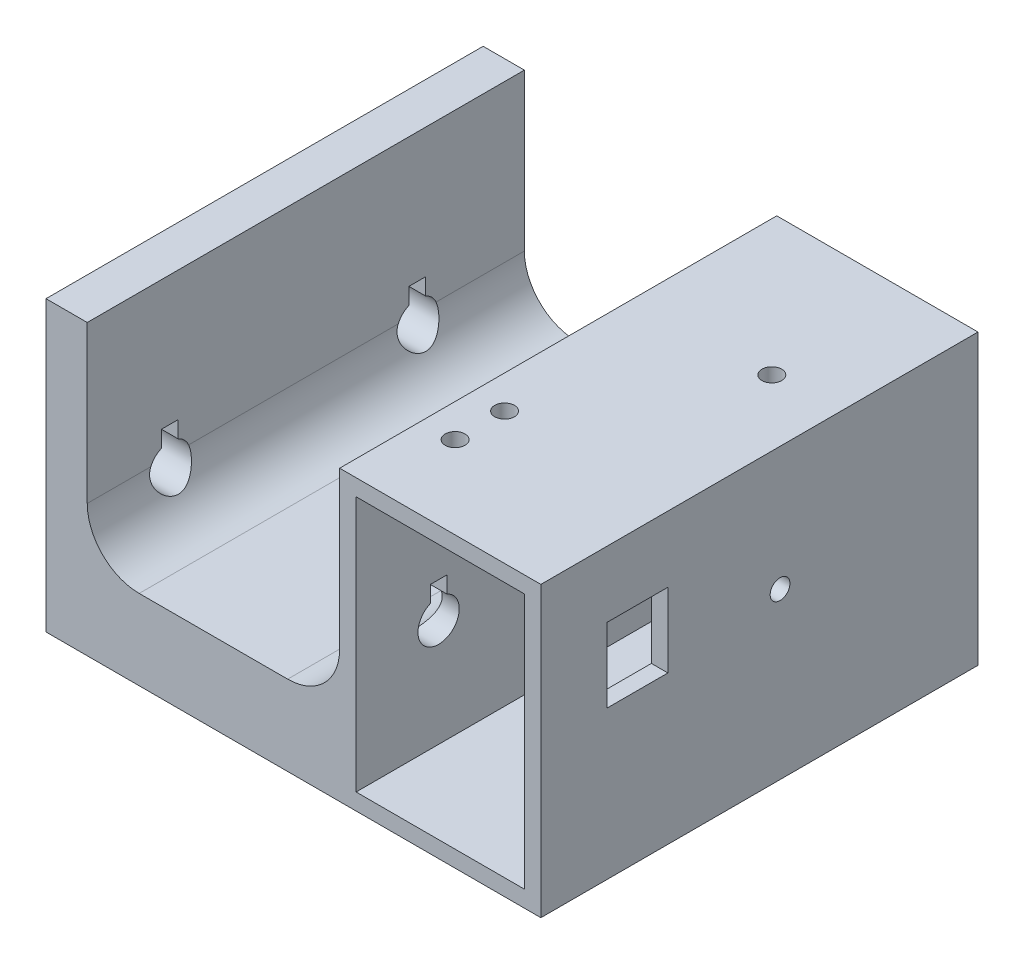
ISO-10303-21;
HEADER;
FILE_DESCRIPTION(('STEP AP214'),'2;1');
FILE_NAME('part.step','',(''),(''),'','','');
FILE_SCHEMA(('AUTOMOTIVE_DESIGN { 1 0 10303 214 1 1 1 1 }'));
ENDSEC;
DATA;
#1=APPLICATION_CONTEXT('core data for automotive mechanical design processes');
#2=APPLICATION_PROTOCOL_DEFINITION('international standard','automotive_design',2000,#1);
#3=PRODUCT_CONTEXT('',#1,'mechanical');
#4=PRODUCT('Part','Part','',(#3));
#5=PRODUCT_RELATED_PRODUCT_CATEGORY('part','',(#4));
#6=PRODUCT_DEFINITION_FORMATION('','',#4);
#7=PRODUCT_DEFINITION_CONTEXT('part definition',#1,'design');
#8=PRODUCT_DEFINITION('design','',#6,#7);
#9=PRODUCT_DEFINITION_SHAPE('','',#8);
#10=(LENGTH_UNIT() NAMED_UNIT(*) SI_UNIT(.MILLI.,.METRE.));
#11=(NAMED_UNIT(*) PLANE_ANGLE_UNIT() SI_UNIT($,.RADIAN.));
#12=(NAMED_UNIT(*) SI_UNIT($,.STERADIAN.) SOLID_ANGLE_UNIT());
#13=UNCERTAINTY_MEASURE_WITH_UNIT(LENGTH_MEASURE(1.E-05),#10,'distance_accuracy_value','');
#14=(GEOMETRIC_REPRESENTATION_CONTEXT(3) GLOBAL_UNCERTAINTY_ASSIGNED_CONTEXT((#13)) GLOBAL_UNIT_ASSIGNED_CONTEXT((#10,
#11,#12)) REPRESENTATION_CONTEXT('',''));
#15=CARTESIAN_POINT('',(0.,0.,0.));
#16=DIRECTION('',(0.,0.,1.));
#17=DIRECTION('',(1.,0.,0.));
#18=AXIS2_PLACEMENT_3D('',#15,#16,#17);
#19=CARTESIAN_POINT('',(0.,0.,67.31));
#20=DIRECTION('',(1.,0.,0.));
#21=DIRECTION('',(0.,0.,-1.));
#22=AXIS2_PLACEMENT_3D('',#19,#20,#21);
#23=PLANE('',#22);
#24=DIRECTION('',(0.,1.,0.));
#25=VECTOR('',#24,1.);
#26=CARTESIAN_POINT('',(0.,24.499935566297,17.78));
#27=LINE('',#26,#25);
#28=CARTESIAN_POINT('',(0.,21.9599355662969,17.78));
#29=VERTEX_POINT('',#28);
#30=CARTESIAN_POINT('',(0.,24.499935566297,17.78));
#31=VERTEX_POINT('',#30);
#32=EDGE_CURVE('E337',#29,#31,#27,.T.);
#33=ORIENTED_EDGE('',*,*,#32,.F.);
#34=CARTESIAN_POINT('',(0.,19.05,16.51));
#35=DIRECTION('',(-1.,0.,0.));
#36=DIRECTION('',(0.,0.,1.));
#37=AXIS2_PLACEMENT_3D('',#34,#35,#36);
#38=CIRCLE('',#37,3.17499999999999);
#39=CARTESIAN_POINT('',(0.,21.9599355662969,15.24));
#40=VERTEX_POINT('',#39);
#41=EDGE_CURVE('E326',#40,#29,#38,.T.);
#42=ORIENTED_EDGE('',*,*,#41,.F.);
#43=DIRECTION('',(0.,-1.,0.));
#44=VECTOR('',#43,1.);
#45=CARTESIAN_POINT('',(0.,21.9599355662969,15.24));
#46=LINE('',#45,#44);
#47=CARTESIAN_POINT('',(0.,24.499935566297,15.24));
#48=VERTEX_POINT('',#47);
#49=EDGE_CURVE('E343',#48,#40,#46,.T.);
#50=ORIENTED_EDGE('',*,*,#49,.F.);
#51=DIRECTION('',(0.,0.,-1.));
#52=VECTOR('',#51,1.);
#53=CARTESIAN_POINT('',(0.,24.499935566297,15.24));
#54=LINE('',#53,#52);
#55=EDGE_CURVE('E340',#31,#48,#54,.T.);
#56=ORIENTED_EDGE('',*,*,#55,.F.);
#57=EDGE_LOOP('',(#33,#42,#50,#56));
#58=FACE_BOUND('',#57,.T.);
#59=DIRECTION('',(0.,1.,0.));
#60=VECTOR('',#59,1.);
#61=CARTESIAN_POINT('',(0.,24.499935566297,55.88));
#62=LINE('',#61,#60);
#63=CARTESIAN_POINT('',(0.,21.959935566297,55.88));
#64=VERTEX_POINT('',#63);
#65=CARTESIAN_POINT('',(0.,24.499935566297,55.88));
#66=VERTEX_POINT('',#65);
#67=EDGE_CURVE('E651',#64,#66,#62,.T.);
#68=ORIENTED_EDGE('',*,*,#67,.F.);
#69=CARTESIAN_POINT('',(0.,19.05,54.61));
#70=DIRECTION('',(-1.,0.,0.));
#71=DIRECTION('',(0.,0.,1.));
#72=AXIS2_PLACEMENT_3D('',#69,#70,#71);
#73=CIRCLE('',#72,3.175);
#74=CARTESIAN_POINT('',(0.,21.9599355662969,53.34));
#75=VERTEX_POINT('',#74);
#76=EDGE_CURVE('E653',#75,#64,#73,.T.);
#77=ORIENTED_EDGE('',*,*,#76,.F.);
#78=DIRECTION('',(0.,-1.,0.));
#79=VECTOR('',#78,1.);
#80=CARTESIAN_POINT('',(0.,21.9599355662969,53.34));
#81=LINE('',#80,#79);
#82=CARTESIAN_POINT('',(0.,24.499935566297,53.34));
#83=VERTEX_POINT('',#82);
#84=EDGE_CURVE('E659',#83,#75,#81,.T.);
#85=ORIENTED_EDGE('',*,*,#84,.F.);
#86=DIRECTION('',(0.,0.,-1.));
#87=VECTOR('',#86,1.);
#88=CARTESIAN_POINT('',(0.,24.499935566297,53.34));
#89=LINE('',#88,#87);
#90=EDGE_CURVE('E655',#66,#83,#89,.T.);
#91=ORIENTED_EDGE('',*,*,#90,.F.);
#92=EDGE_LOOP('',(#68,#77,#85,#91));
#93=FACE_BOUND('',#92,.T.);
#94=DIRECTION('',(0.,-1.,0.));
#95=VECTOR('',#94,1.);
#96=CARTESIAN_POINT('',(0.,0.,0.));
#97=LINE('',#96,#95);
#98=CARTESIAN_POINT('',(0.,44.45,0.));
#99=VERTEX_POINT('',#98);
#100=CARTESIAN_POINT('',(0.,0.,0.));
#101=VERTEX_POINT('',#100);
#102=EDGE_CURVE('E487',#99,#101,#97,.T.);
#103=ORIENTED_EDGE('',*,*,#102,.T.);
#104=DIRECTION('',(0.,0.,-1.));
#105=VECTOR('',#104,1.);
#106=CARTESIAN_POINT('',(0.,0.,67.31));
#107=LINE('',#106,#105);
#108=CARTESIAN_POINT('',(0.,0.,67.31));
#109=VERTEX_POINT('',#108);
#110=EDGE_CURVE('E11',#109,#101,#107,.T.);
#111=ORIENTED_EDGE('',*,*,#110,.F.);
#112=DIRECTION('',(0.,-1.,0.));
#113=VECTOR('',#112,1.);
#114=CARTESIAN_POINT('',(0.,0.,67.31));
#115=LINE('',#114,#113);
#116=CARTESIAN_POINT('',(0.,44.45,67.31));
#117=VERTEX_POINT('',#116);
#118=EDGE_CURVE('E515',#117,#109,#115,.T.);
#119=ORIENTED_EDGE('',*,*,#118,.F.);
#120=DIRECTION('',(0.,0.,-1.));
#121=VECTOR('',#120,1.);
#122=CARTESIAN_POINT('',(0.,44.45,67.31));
#123=LINE('',#122,#121);
#124=EDGE_CURVE('E516',#117,#99,#123,.T.);
#125=ORIENTED_EDGE('',*,*,#124,.T.);
#126=EDGE_LOOP('',(#103,#111,#119,#125));
#127=FACE_BOUND('',#126,.T.);
#128=ADVANCED_FACE('F33',(#58,#93,#127),#23,.F.);
#129=CARTESIAN_POINT('',(0.,0.,67.31));
#130=DIRECTION('',(0.,1.,0.));
#131=DIRECTION('',(0.,0.,1.));
#132=AXIS2_PLACEMENT_3D('',#129,#130,#131);
#133=PLANE('',#132);
#134=DIRECTION('',(1.,0.,0.));
#135=VECTOR('',#134,1.);
#136=CARTESIAN_POINT('',(0.,0.,0.));
#137=LINE('',#136,#135);
#138=CARTESIAN_POINT('',(76.2,0.,0.));
#139=VERTEX_POINT('',#138);
#140=EDGE_CURVE('E478',#101,#139,#137,.T.);
#141=ORIENTED_EDGE('',*,*,#140,.T.);
#142=DIRECTION('',(0.,0.,-1.));
#143=VECTOR('',#142,1.);
#144=CARTESIAN_POINT('',(76.2,0.,67.31));
#145=LINE('',#144,#143);
#146=CARTESIAN_POINT('',(76.2,0.,67.31));
#147=VERTEX_POINT('',#146);
#148=EDGE_CURVE('E40',#147,#139,#145,.T.);
#149=ORIENTED_EDGE('',*,*,#148,.F.);
#150=DIRECTION('',(1.,0.,0.));
#151=VECTOR('',#150,1.);
#152=CARTESIAN_POINT('',(0.,0.,67.31));
#153=LINE('',#152,#151);
#154=EDGE_CURVE('E552',#109,#147,#153,.T.);
#155=ORIENTED_EDGE('',*,*,#154,.F.);
#156=ORIENTED_EDGE('',*,*,#110,.T.);
#157=EDGE_LOOP('',(#141,#149,#155,#156));
#158=FACE_BOUND('',#157,.T.);
#159=ADVANCED_FACE('F469',(#158),#133,.F.);
#160=CARTESIAN_POINT('',(76.2,0.,67.31));
#161=DIRECTION('',(-1.,0.,0.));
#162=DIRECTION('',(0.,0.,1.));
#163=AXIS2_PLACEMENT_3D('',#160,#161,#162);
#164=PLANE('',#163);
#165=CARTESIAN_POINT('',(76.2,25.4,30.48));
#166=DIRECTION('',(1.,0.,0.));
#167=DIRECTION('',(0.,0.,-1.));
#168=AXIS2_PLACEMENT_3D('',#165,#166,#167);
#169=CIRCLE('',#168,1.524);
#170=CARTESIAN_POINT('',(76.2,25.4,28.956));
#171=VERTEX_POINT('',#170);
#172=EDGE_CURVE('E1083',#171,#171,#169,.T.);
#173=ORIENTED_EDGE('',*,*,#172,.F.);
#174=EDGE_LOOP('',(#173));
#175=FACE_BOUND('',#174,.T.);
#176=DIRECTION('',(0.,0.,-1.));
#177=VECTOR('',#176,1.);
#178=CARTESIAN_POINT('',(76.2,22.86,57.15));
#179=LINE('',#178,#177);
#180=CARTESIAN_POINT('',(76.2,22.86,57.15));
#181=VERTEX_POINT('',#180);
#182=CARTESIAN_POINT('',(76.2,22.86,47.752));
#183=VERTEX_POINT('',#182);
#184=EDGE_CURVE('E289',#181,#183,#179,.T.);
#185=ORIENTED_EDGE('',*,*,#184,.F.);
#186=DIRECTION('',(0.,-1.,0.));
#187=VECTOR('',#186,1.);
#188=CARTESIAN_POINT('',(76.2,34.29,57.15));
#189=LINE('',#188,#187);
#190=CARTESIAN_POINT('',(76.2,34.29,57.15));
#191=VERTEX_POINT('',#190);
#192=EDGE_CURVE('E47',#191,#181,#189,.T.);
#193=ORIENTED_EDGE('',*,*,#192,.F.);
#194=DIRECTION('',(0.,0.,1.));
#195=VECTOR('',#194,1.);
#196=CARTESIAN_POINT('',(76.2,34.29,57.15));
#197=LINE('',#196,#195);
#198=CARTESIAN_POINT('',(76.2,34.29,47.752));
#199=VERTEX_POINT('',#198);
#200=EDGE_CURVE('E296',#199,#191,#197,.T.);
#201=ORIENTED_EDGE('',*,*,#200,.F.);
#202=DIRECTION('',(0.,1.,0.));
#203=VECTOR('',#202,1.);
#204=CARTESIAN_POINT('',(76.2,34.29,47.752));
#205=LINE('',#204,#203);
#206=EDGE_CURVE('E280',#183,#199,#205,.T.);
#207=ORIENTED_EDGE('',*,*,#206,.F.);
#208=EDGE_LOOP('',(#185,#193,#201,#207));
#209=FACE_BOUND('',#208,.T.);
#210=DIRECTION('',(0.,1.,0.));
#211=VECTOR('',#210,1.);
#212=CARTESIAN_POINT('',(76.2,0.,0.));
#213=LINE('',#212,#211);
#214=CARTESIAN_POINT('',(76.2,44.45,0.));
#215=VERTEX_POINT('',#214);
#216=EDGE_CURVE('E486',#139,#215,#213,.T.);
#217=ORIENTED_EDGE('',*,*,#216,.T.);
#218=DIRECTION('',(0.,0.,-1.));
#219=VECTOR('',#218,1.);
#220=CARTESIAN_POINT('',(76.2,44.45,67.31));
#221=LINE('',#220,#219);
#222=CARTESIAN_POINT('',(76.2,44.45,67.31));
#223=VERTEX_POINT('',#222);
#224=EDGE_CURVE('E492',#223,#215,#221,.T.);
#225=ORIENTED_EDGE('',*,*,#224,.F.);
#226=DIRECTION('',(0.,1.,0.));
#227=VECTOR('',#226,1.);
#228=CARTESIAN_POINT('',(76.2,0.,67.31));
#229=LINE('',#228,#227);
#230=EDGE_CURVE('E491',#147,#223,#229,.T.);
#231=ORIENTED_EDGE('',*,*,#230,.F.);
#232=ORIENTED_EDGE('',*,*,#148,.T.);
#233=EDGE_LOOP('',(#217,#225,#231,#232));
#234=FACE_BOUND('',#233,.T.);
#235=ADVANCED_FACE('F293',(#175,#209,#234),#164,.F.);
#236=CARTESIAN_POINT('',(45.212,44.45,67.31));
#237=DIRECTION('',(0.,-1.,0.));
#238=DIRECTION('',(0.,0.,-1.));
#239=AXIS2_PLACEMENT_3D('',#236,#237,#238);
#240=PLANE('',#239);
#241=CARTESIAN_POINT('',(50.292,44.45,54.61));
#242=DIRECTION('',(0.,1.,0.));
#243=DIRECTION('',(0.,0.,1.));
#244=AXIS2_PLACEMENT_3D('',#241,#242,#243);
#245=CIRCLE('',#244,1.524);
#246=CARTESIAN_POINT('',(50.292,44.45,56.134));
#247=VERTEX_POINT('',#246);
#248=EDGE_CURVE('E307',#247,#247,#245,.T.);
#249=ORIENTED_EDGE('',*,*,#248,.F.);
#250=EDGE_LOOP('',(#249));
#251=FACE_BOUND('',#250,.T.);
#252=CARTESIAN_POINT('',(50.292,44.45,46.99));
#253=DIRECTION('',(0.,1.,0.));
#254=DIRECTION('',(0.,0.,1.));
#255=AXIS2_PLACEMENT_3D('',#252,#253,#254);
#256=CIRCLE('',#255,1.524);
#257=CARTESIAN_POINT('',(50.292,44.45,48.514));
#258=VERTEX_POINT('',#257);
#259=EDGE_CURVE('E314',#258,#258,#256,.T.);
#260=ORIENTED_EDGE('',*,*,#259,.F.);
#261=EDGE_LOOP('',(#260));
#262=FACE_BOUND('',#261,.T.);
#263=CARTESIAN_POINT('',(66.04,44.45,21.59));
#264=DIRECTION('',(0.,1.,0.));
#265=DIRECTION('',(0.,0.,1.));
#266=AXIS2_PLACEMENT_3D('',#263,#264,#265);
#267=CIRCLE('',#266,1.52399999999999);
#268=CARTESIAN_POINT('',(66.04,44.45,23.114));
#269=VERTEX_POINT('',#268);
#270=EDGE_CURVE('E320',#269,#269,#267,.T.);
#271=ORIENTED_EDGE('',*,*,#270,.F.);
#272=EDGE_LOOP('',(#271));
#273=FACE_BOUND('',#272,.T.);
#274=DIRECTION('',(-1.,0.,0.));
#275=VECTOR('',#274,1.);
#276=CARTESIAN_POINT('',(45.212,44.45,0.));
#277=LINE('',#276,#275);
#278=CARTESIAN_POINT('',(45.212,44.45,0.));
#279=VERTEX_POINT('',#278);
#280=EDGE_CURVE('E496',#215,#279,#277,.T.);
#281=ORIENTED_EDGE('',*,*,#280,.T.);
#282=DIRECTION('',(0.,0.,-1.));
#283=VECTOR('',#282,1.);
#284=CARTESIAN_POINT('',(45.212,44.45,67.31));
#285=LINE('',#284,#283);
#286=CARTESIAN_POINT('',(45.212,44.45,67.31));
#287=VERTEX_POINT('',#286);
#288=EDGE_CURVE('E538',#287,#279,#285,.T.);
#289=ORIENTED_EDGE('',*,*,#288,.F.);
#290=DIRECTION('',(-1.,0.,0.));
#291=VECTOR('',#290,1.);
#292=CARTESIAN_POINT('',(45.212,44.45,67.31));
#293=LINE('',#292,#291);
#294=EDGE_CURVE('E545',#223,#287,#293,.T.);
#295=ORIENTED_EDGE('',*,*,#294,.F.);
#296=ORIENTED_EDGE('',*,*,#224,.T.);
#297=EDGE_LOOP('',(#281,#289,#295,#296));
#298=FACE_BOUND('',#297,.T.);
#299=ADVANCED_FACE('F463',(#251,#262,#273,#298),#240,.F.);
#300=CARTESIAN_POINT('',(45.212,44.45,67.31));
#301=DIRECTION('',(1.,0.,0.));
#302=DIRECTION('',(0.,0.,-1.));
#303=AXIS2_PLACEMENT_3D('',#300,#301,#302);
#304=PLANE('',#303);
#305=DIRECTION('',(0.,-1.,0.));
#306=VECTOR('',#305,1.);
#307=CARTESIAN_POINT('',(45.212,44.4499999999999,17.78));
#308=LINE('',#307,#306);
#309=CARTESIAN_POINT('',(45.212,24.499935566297,17.78));
#310=VERTEX_POINT('',#309);
#311=CARTESIAN_POINT('',(45.212,21.9599355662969,17.78));
#312=VERTEX_POINT('',#311);
#313=EDGE_CURVE('E365',#310,#312,#308,.T.);
#314=ORIENTED_EDGE('',*,*,#313,.T.);
#315=CARTESIAN_POINT('',(45.212,19.05,16.51));
#316=DIRECTION('',(1.,0.,0.));
#317=DIRECTION('',(0.,0.,-1.));
#318=AXIS2_PLACEMENT_3D('',#315,#316,#317);
#319=CIRCLE('',#318,3.17499999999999);
#320=CARTESIAN_POINT('',(45.2120000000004,20.3200000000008,19.4199355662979));
#321=VERTEX_POINT('',#320);
#322=EDGE_CURVE('E661',#312,#321,#319,.T.);
#323=ORIENTED_EDGE('',*,*,#322,.T.);
#324=DIRECTION('',(0.,0.,-1.));
#325=VECTOR('',#324,1.);
#326=CARTESIAN_POINT('',(45.212,20.32,67.31));
#327=LINE('',#326,#325);
#328=CARTESIAN_POINT('',(45.212,20.32,51.700064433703));
#329=VERTEX_POINT('',#328);
#330=EDGE_CURVE('E539',#329,#321,#327,.T.);
#331=ORIENTED_EDGE('',*,*,#330,.F.);
#332=CARTESIAN_POINT('',(45.212,19.05,54.61));
#333=DIRECTION('',(1.,0.,0.));
#334=DIRECTION('',(0.,0.,-1.));
#335=AXIS2_PLACEMENT_3D('',#332,#333,#334);
#336=CIRCLE('',#335,3.175);
#337=CARTESIAN_POINT('',(45.212,21.9599355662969,53.34));
#338=VERTEX_POINT('',#337);
#339=EDGE_CURVE('E450',#329,#338,#336,.T.);
#340=ORIENTED_EDGE('',*,*,#339,.T.);
#341=DIRECTION('',(0.,1.,0.));
#342=VECTOR('',#341,1.);
#343=CARTESIAN_POINT('',(45.212,44.45,53.34));
#344=LINE('',#343,#342);
#345=CARTESIAN_POINT('',(45.212,24.499935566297,53.34));
#346=VERTEX_POINT('',#345);
#347=EDGE_CURVE('E622',#338,#346,#344,.T.);
#348=ORIENTED_EDGE('',*,*,#347,.T.);
#349=DIRECTION('',(0.,0.,1.));
#350=VECTOR('',#349,1.);
#351=CARTESIAN_POINT('',(45.212,24.499935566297,67.31));
#352=LINE('',#351,#350);
#353=CARTESIAN_POINT('',(45.212,24.499935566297,55.88));
#354=VERTEX_POINT('',#353);
#355=EDGE_CURVE('E693',#346,#354,#352,.T.);
#356=ORIENTED_EDGE('',*,*,#355,.T.);
#357=DIRECTION('',(0.,-1.,0.));
#358=VECTOR('',#357,1.);
#359=CARTESIAN_POINT('',(45.212,44.45,55.88));
#360=LINE('',#359,#358);
#361=CARTESIAN_POINT('',(45.212,21.959935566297,55.88));
#362=VERTEX_POINT('',#361);
#363=EDGE_CURVE('E688',#354,#362,#360,.T.);
#364=ORIENTED_EDGE('',*,*,#363,.T.);
#365=CARTESIAN_POINT('',(45.212,20.32,57.519935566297));
#366=VERTEX_POINT('',#365);
#367=EDGE_CURVE('E712',#362,#366,#336,.T.);
#368=ORIENTED_EDGE('',*,*,#367,.T.);
#369=CARTESIAN_POINT('',(45.212,20.32,67.31));
#370=VERTEX_POINT('',#369);
#371=EDGE_CURVE('E535',#370,#366,#327,.T.);
#372=ORIENTED_EDGE('',*,*,#371,.F.);
#373=DIRECTION('',(0.,-1.,0.));
#374=VECTOR('',#373,1.);
#375=CARTESIAN_POINT('',(45.212,44.45,67.31));
#376=LINE('',#375,#374);
#377=EDGE_CURVE('E548',#287,#370,#376,.T.);
#378=ORIENTED_EDGE('',*,*,#377,.F.);
#379=ORIENTED_EDGE('',*,*,#288,.T.);
#380=DIRECTION('',(0.,-1.,0.));
#381=VECTOR('',#380,1.);
#382=CARTESIAN_POINT('',(45.212,44.45,0.));
#383=LINE('',#382,#381);
#384=CARTESIAN_POINT('',(45.212,20.32,0.));
#385=VERTEX_POINT('',#384);
#386=EDGE_CURVE('E498',#279,#385,#383,.T.);
#387=ORIENTED_EDGE('',*,*,#386,.T.);
#388=CARTESIAN_POINT('',(45.212,20.32,13.600064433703));
#389=VERTEX_POINT('',#388);
#390=EDGE_CURVE('E534',#389,#385,#327,.T.);
#391=ORIENTED_EDGE('',*,*,#390,.F.);
#392=CARTESIAN_POINT('',(45.212,21.9599355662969,15.24));
#393=VERTEX_POINT('',#392);
#394=EDGE_CURVE('E707',#389,#393,#319,.T.);
#395=ORIENTED_EDGE('',*,*,#394,.T.);
#396=DIRECTION('',(0.,1.,0.));
#397=VECTOR('',#396,1.);
#398=CARTESIAN_POINT('',(45.212,44.45,15.24));
#399=LINE('',#398,#397);
#400=CARTESIAN_POINT('',(45.212,24.499935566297,15.24));
#401=VERTEX_POINT('',#400);
#402=EDGE_CURVE('E377',#393,#401,#399,.T.);
#403=ORIENTED_EDGE('',*,*,#402,.T.);
#404=DIRECTION('',(0.,0.,1.));
#405=VECTOR('',#404,1.);
#406=CARTESIAN_POINT('',(45.212,24.499935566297,67.31));
#407=LINE('',#406,#405);
#408=EDGE_CURVE('E371',#401,#310,#407,.T.);
#409=ORIENTED_EDGE('',*,*,#408,.T.);
#410=EDGE_LOOP('',(#314,#323,#331,#340,#348,#356,#364,#368,#372,#378,#379,#387,#391,#395,#403,#409));
#411=FACE_BOUND('',#410,.T.);
#412=ADVANCED_FACE('F458',(#411),#304,.F.);
#413=CARTESIAN_POINT('',(37.211,20.32,67.31));
#414=DIRECTION('',(0.,0.,-1.));
#415=DIRECTION('',(-1.,0.,0.));
#416=AXIS2_PLACEMENT_3D('',#413,#414,#415);
#417=CYLINDRICAL_SURFACE('',#416,8.001);
#418=ORIENTED_EDGE('',*,*,#330,.T.);
#419=CARTESIAN_POINT('',(45.0421309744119,21.9599355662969,17.78));
#420=CARTESIAN_POINT('',(45.049612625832,21.9241832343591,17.8619141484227));
#421=CARTESIAN_POINT('',(45.0575661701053,21.8850081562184,17.9422403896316));
#422=CARTESIAN_POINT('',(45.074034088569,21.8000638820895,18.0992609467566));
#423=CARTESIAN_POINT('',(45.0825484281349,21.7542950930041,18.1759554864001));
#424=CARTESIAN_POINT('',(45.1083558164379,21.6074904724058,18.3998879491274));
#425=CARTESIAN_POINT('',(45.1259170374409,21.4969396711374,18.5410129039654));
#426=CARTESIAN_POINT('',(45.1583060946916,21.2534823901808,18.8028828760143));
#427=CARTESIAN_POINT('',(45.173132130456,21.1205612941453,18.9236144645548));
#428=CARTESIAN_POINT('',(45.1966177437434,20.835978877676,19.1411449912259));
#429=CARTESIAN_POINT('',(45.2052815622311,20.6843305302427,19.2379603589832));
#430=CARTESIAN_POINT('',(45.2133622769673,20.3696743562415,19.4031041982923));
#431=CARTESIAN_POINT('',(45.2129520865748,20.2069377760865,19.4719399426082));
#432=CARTESIAN_POINT('',(45.2012315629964,19.8726461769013,19.5816118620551));
#433=CARTESIAN_POINT('',(45.1899228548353,19.7010924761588,19.6224522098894));
#434=CARTESIAN_POINT('',(45.1562422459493,19.362510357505,19.6740140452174));
#435=CARTESIAN_POINT('',(45.1343852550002,19.1956204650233,19.6859953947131));
#436=CARTESIAN_POINT('',(45.0801580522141,18.8637633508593,19.6838747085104));
#437=CARTESIAN_POINT('',(45.0477878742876,18.6987961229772,19.6697727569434));
#438=CARTESIAN_POINT('',(44.9734143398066,18.3734458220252,19.6165033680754));
#439=CARTESIAN_POINT('',(44.9313160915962,18.2131266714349,19.5770817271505));
#440=CARTESIAN_POINT('',(44.8397254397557,17.9023923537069,19.4748611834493));
#441=CARTESIAN_POINT('',(44.7902308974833,17.7519800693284,19.4120555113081));
#442=CARTESIAN_POINT('',(44.6821963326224,17.4521394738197,19.2591875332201));
#443=CARTESIAN_POINT('',(44.6232485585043,17.3037728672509,19.1673327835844));
#444=CARTESIAN_POINT('',(44.5033397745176,17.0244059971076,18.961078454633));
#445=CARTESIAN_POINT('',(44.4423770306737,16.8934212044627,18.8466590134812));
#446=CARTESIAN_POINT('',(44.3177647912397,16.6415235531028,18.5872926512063));
#447=CARTESIAN_POINT('',(44.2542968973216,16.5222826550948,18.4406249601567));
#448=CARTESIAN_POINT('',(44.1359379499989,16.3105143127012,18.1260738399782));
#449=CARTESIAN_POINT('',(44.0810381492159,16.2179595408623,17.9582123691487));
#450=CARTESIAN_POINT('',(43.9959963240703,16.0791179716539,17.6405657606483));
#451=CARTESIAN_POINT('',(43.9630947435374,16.0272663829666,17.4939522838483));
#452=CARTESIAN_POINT('',(43.9102953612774,15.9453171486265,17.1925613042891));
#453=CARTESIAN_POINT('',(43.8903839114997,15.9151966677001,17.0377925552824));
#454=CARTESIAN_POINT('',(43.8658675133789,15.8782365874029,16.7236359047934));
#455=CARTESIAN_POINT('',(43.8613225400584,15.8714882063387,16.5642323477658));
#456=CARTESIAN_POINT('',(43.868313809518,15.8819590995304,16.2465574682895));
#457=CARTESIAN_POINT('',(43.879852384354,15.8991818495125,16.0882863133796));
#458=CARTESIAN_POINT('',(43.9163804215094,15.9548116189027,15.7871670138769));
#459=CARTESIAN_POINT('',(43.9405232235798,15.9918886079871,15.6439628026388));
#460=CARTESIAN_POINT('',(43.999272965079,16.0846313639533,15.3660152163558));
#461=CARTESIAN_POINT('',(44.0338831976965,16.1403029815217,15.2312745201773));
#462=CARTESIAN_POINT('',(44.1144092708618,16.2745559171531,14.9599688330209));
#463=CARTESIAN_POINT('',(44.1610914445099,16.3548233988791,14.8244702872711));
#464=CARTESIAN_POINT('',(44.2599112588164,16.5332782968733,14.5680490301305));
#465=CARTESIAN_POINT('',(44.3120521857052,16.6314765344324,14.44713519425));
#466=CARTESIAN_POINT('',(44.426649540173,16.8603500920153,14.2039051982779));
#467=CARTESIAN_POINT('',(44.4894553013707,16.9936990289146,14.0842573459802));
#468=CARTESIAN_POINT('',(44.6132679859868,17.2791691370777,13.8686367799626));
#469=CARTESIAN_POINT('',(44.674274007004,17.4312995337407,13.7726757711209));
#470=CARTESIAN_POINT('',(44.7934094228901,17.7597110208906,13.6028257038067));
#471=CARTESIAN_POINT('',(44.8512285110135,17.9368327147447,13.5303291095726));
#472=CARTESIAN_POINT('',(44.9562250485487,18.3040966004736,13.4179037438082));
#473=CARTESIAN_POINT('',(45.0034096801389,18.4942298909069,13.3779529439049));
#474=CARTESIAN_POINT('',(45.0810262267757,18.8666958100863,13.3351865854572));
#475=CARTESIAN_POINT('',(45.1124604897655,19.0485193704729,13.3297740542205));
#476=CARTESIAN_POINT('',(45.1624395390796,19.4121310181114,13.3504758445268));
#477=CARTESIAN_POINT('',(45.1809905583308,19.5939190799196,13.3765749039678));
#478=CARTESIAN_POINT('',(45.2045103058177,19.9366497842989,13.4566502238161));
#479=CARTESIAN_POINT('',(45.2104496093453,20.0980944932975,13.5082210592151));
#480=CARTESIAN_POINT('',(45.2130129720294,20.4107595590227,13.6364132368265));
#481=CARTESIAN_POINT('',(45.2096376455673,20.5619805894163,13.713032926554));
#482=CARTESIAN_POINT('',(45.1957275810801,20.8500557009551,13.8891339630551));
#483=CARTESIAN_POINT('',(45.1851926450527,20.9869093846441,13.9886159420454));
#484=CARTESIAN_POINT('',(45.1596376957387,21.2428949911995,14.2077738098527));
#485=CARTESIAN_POINT('',(45.1446164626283,21.3620220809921,14.3274551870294));
#486=CARTESIAN_POINT('',(45.1142494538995,21.570957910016,14.5736868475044));
#487=CARTESIAN_POINT('',(45.0990278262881,21.6623573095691,14.6989021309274));
#488=CARTESIAN_POINT('',(45.0768406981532,21.7850180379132,14.8956014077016));
#489=CARTESIAN_POINT('',(45.069553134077,21.8234958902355,14.9626411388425));
#490=CARTESIAN_POINT('',(45.0554366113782,21.8954839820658,15.0993924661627));
#491=CARTESIAN_POINT('',(45.0486077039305,21.9289936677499,15.1691043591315));
#492=CARTESIAN_POINT('',(45.0421309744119,21.9599355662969,15.24));
#493=B_SPLINE_CURVE_WITH_KNOTS('',3,(#419,#420,#421,#422,#423,#424,#425,#426,#427,#428,#429,
#430,#431,#432,#433,#434,#435,#436,#437,#438,#439,#440,#441,#442,#443,#444,#445,#446,#447,#448,
#449,#450,#451,#452,#453,#454,#455,#456,#457,#458,#459,#460,#461,#462,#463,#464,#465,#466,#467,
#468,#469,#470,#471,#472,#473,#474,#475,#476,#477,#478,#479,#480,#481,#482,#483,#484,#485,#486,
#487,#488,#489,#490,#491,#492),.UNSPECIFIED.,.F.,.F.,(4,2,2,2,2,2,2,2,2,2,2,2,2,2,2,2,2,2,2,2,2,
2,2,2,2,2,2,2,2,2,2,2,2,2,2,2,4),(0.,0.268896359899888,0.537776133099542,1.07541168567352,
1.61339989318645,2.15101748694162,2.6783992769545,3.20570244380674,3.70953172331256,
4.21335937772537,4.72232613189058,5.23144033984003,5.78169524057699,6.33243666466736,
6.92773079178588,7.52241313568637,7.99728512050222,8.47165737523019,8.94787897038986,
9.42416962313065,9.87194486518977,10.3198611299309,10.8107737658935,11.3019836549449,
11.8690680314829,12.4364320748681,13.0330374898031,13.6292387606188,14.1800241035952,
14.7305427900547,15.2368789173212,15.7431816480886,16.2494983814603,16.755952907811,
17.2215122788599,17.4542523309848,17.6870183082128),.UNSPECIFIED.);
#494=EDGE_CURVE('E392',#321,#389,#493,.T.);
#495=ORIENTED_EDGE('',*,*,#494,.T.);
#496=ORIENTED_EDGE('',*,*,#390,.T.);
#497=CARTESIAN_POINT('',(37.211,20.32,0.));
#498=DIRECTION('',(0.,0.,-1.));
#499=DIRECTION('',(1.,0.,0.));
#500=AXIS2_PLACEMENT_3D('',#497,#498,#499);
#501=CIRCLE('',#500,8.001);
#502=CARTESIAN_POINT('',(37.211,12.319,0.));
#503=VERTEX_POINT('',#502);
#504=EDGE_CURVE('E504',#385,#503,#501,.T.);
#505=ORIENTED_EDGE('',*,*,#504,.T.);
#506=DIRECTION('',(0.,0.,-1.));
#507=VECTOR('',#506,1.);
#508=CARTESIAN_POINT('',(37.211,12.319,67.31));
#509=LINE('',#508,#507);
#510=CARTESIAN_POINT('',(37.211,12.319,67.31));
#511=VERTEX_POINT('',#510);
#512=EDGE_CURVE('E531',#511,#503,#509,.T.);
#513=ORIENTED_EDGE('',*,*,#512,.F.);
#514=CARTESIAN_POINT('',(37.211,20.32,67.31));
#515=DIRECTION('',(0.,0.,-1.));
#516=DIRECTION('',(1.,0.,0.));
#517=AXIS2_PLACEMENT_3D('',#514,#515,#516);
#518=CIRCLE('',#517,8.001);
#519=EDGE_CURVE('E550',#370,#511,#518,.T.);
#520=ORIENTED_EDGE('',*,*,#519,.F.);
#521=ORIENTED_EDGE('',*,*,#371,.T.);
#522=CARTESIAN_POINT('',(45.212,20.32,57.519935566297));
#523=CARTESIAN_POINT('',(45.2120098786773,20.2426773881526,57.5536941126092));
#524=CARTESIAN_POINT('',(45.2108793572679,20.163999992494,57.5843503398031));
#525=CARTESIAN_POINT('',(45.2061734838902,20.0045250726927,57.6392905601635));
#526=CARTESIAN_POINT('',(45.2025982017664,19.9237276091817,57.663574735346));
#527=CARTESIAN_POINT('',(45.1928508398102,19.7607988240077,57.7055533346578));
#528=CARTESIAN_POINT('',(45.1866851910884,19.6786712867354,57.723263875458));
#529=CARTESIAN_POINT('',(45.1716850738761,19.513534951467,57.7521006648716));
#530=CARTESIAN_POINT('',(45.1628507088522,19.4305261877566,57.7632271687));
#531=CARTESIAN_POINT('',(45.1322765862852,19.1809976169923,57.7866818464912));
#532=CARTESIAN_POINT('',(45.1064626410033,19.0139207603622,57.7890991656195));
#533=CARTESIAN_POINT('',(45.0446459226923,18.6834362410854,57.7681225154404));
#534=CARTESIAN_POINT('',(45.0086416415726,18.5200291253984,57.7447247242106));
#535=CARTESIAN_POINT('',(44.9272462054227,18.1978162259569,57.6730295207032));
#536=CARTESIAN_POINT('',(44.8816911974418,18.0391548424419,57.6242719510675));
#537=CARTESIAN_POINT('',(44.7839488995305,17.7330488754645,57.5036773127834));
#538=CARTESIAN_POINT('',(44.731758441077,17.5856097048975,57.4318291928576));
#539=CARTESIAN_POINT('',(44.6187331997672,17.2920716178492,57.2598588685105));
#540=CARTESIAN_POINT('',(44.5575421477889,17.1472453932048,57.157797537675));
#541=CARTESIAN_POINT('',(44.4346112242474,16.8765143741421,56.931161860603));
#542=CARTESIAN_POINT('',(44.3728709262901,16.7506259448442,56.8065682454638));
#543=CARTESIAN_POINT('',(44.2494232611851,16.5126726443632,56.5279138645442));
#544=CARTESIAN_POINT('',(44.1879989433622,16.4021126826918,56.3724324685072));
#545=CARTESIAN_POINT('',(44.0762505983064,16.2094297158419,56.0412070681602));
#546=CARTESIAN_POINT('',(44.0259105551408,16.127265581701,55.8654928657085));
#547=CARTESIAN_POINT('',(43.9523979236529,16.0103348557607,55.5394999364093));
#548=CARTESIAN_POINT('',(43.9256649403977,15.9690721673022,55.3923489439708));
#549=CARTESIAN_POINT('',(43.8857365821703,15.9080555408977,55.0919139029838));
#550=CARTESIAN_POINT('',(43.8725277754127,15.8882802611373,54.9386360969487));
#551=CARTESIAN_POINT('',(43.8611964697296,15.8712917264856,54.6298933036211));
#552=CARTESIAN_POINT('',(43.8631099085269,15.8741322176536,54.4744239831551));
#553=CARTESIAN_POINT('',(43.8818679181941,15.9023320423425,54.1664423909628));
#554=CARTESIAN_POINT('',(43.8987181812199,15.9276999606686,54.0139312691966));
#555=CARTESIAN_POINT('',(43.9446778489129,15.9985100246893,53.7205266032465));
#556=CARTESIAN_POINT('',(43.9734125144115,16.0433404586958,53.5794233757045));
#557=CARTESIAN_POINT('',(44.0403639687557,16.1510917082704,53.3067453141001));
#558=CARTESIAN_POINT('',(44.0785838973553,16.2140185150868,53.1751736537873));
#559=CARTESIAN_POINT('',(44.1665904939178,16.3647193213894,52.90819278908));
#560=CARTESIAN_POINT('',(44.217216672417,16.4545765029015,52.7742397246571));
#561=CARTESIAN_POINT('',(44.3228021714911,16.6524594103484,52.5223931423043));
#562=CARTESIAN_POINT('',(44.377764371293,16.7604972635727,52.4045104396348));
#563=CARTESIAN_POINT('',(44.4965585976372,17.0096621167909,52.1705442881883));
#564=CARTESIAN_POINT('',(44.5605198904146,17.1533158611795,52.0572067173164));
#565=CARTESIAN_POINT('',(44.6848837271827,17.4591880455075,51.8562057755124));
#566=CARTESIAN_POINT('',(44.7452852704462,17.6214116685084,51.7685495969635));
#567=CARTESIAN_POINT('',(44.8307028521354,17.8777564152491,51.6578100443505));
#568=CARTESIAN_POINT('',(44.8585978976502,17.966460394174,51.6240942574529));
#569=CARTESIAN_POINT('',(44.9118939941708,18.1471944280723,51.5645764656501));
#570=CARTESIAN_POINT('',(44.937296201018,18.2392229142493,51.5387707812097));
#571=CARTESIAN_POINT('',(44.9851818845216,18.4259584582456,51.4954555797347));
#572=CARTESIAN_POINT('',(45.007665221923,18.5206656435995,51.4779464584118));
#573=CARTESIAN_POINT('',(45.0493494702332,18.7119424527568,51.4515741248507));
#574=CARTESIAN_POINT('',(45.0685522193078,18.8085109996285,51.4427060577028));
#575=CARTESIAN_POINT('',(45.1019055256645,18.994209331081,51.4342507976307));
#576=CARTESIAN_POINT('',(45.1163507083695,19.0832529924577,51.4339213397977));
#577=CARTESIAN_POINT('',(45.1421777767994,19.2614540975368,51.4407954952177));
#578=CARTESIAN_POINT('',(45.1535611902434,19.3506114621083,51.4479953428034));
#579=CARTESIAN_POINT('',(45.1732290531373,19.5282379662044,51.4699499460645));
#580=CARTESIAN_POINT('',(45.1815167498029,19.6167077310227,51.4846967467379));
#581=CARTESIAN_POINT('',(45.1950617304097,19.792264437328,51.5216817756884));
#582=CARTESIAN_POINT('',(45.200320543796,19.8793520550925,51.5439162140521));
#583=CARTESIAN_POINT('',(45.2068151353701,20.0257329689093,51.5879900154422));
#584=CARTESIAN_POINT('',(45.2087832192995,20.0855631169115,51.6079661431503));
#585=CARTESIAN_POINT('',(45.2113756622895,20.2038425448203,51.6514128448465));
#586=CARTESIAN_POINT('',(45.2120025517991,20.2622942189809,51.6748767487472));
#587=CARTESIAN_POINT('',(45.212,20.32,51.700064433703));
#588=B_SPLINE_CURVE_WITH_KNOTS('',3,(#522,#523,#524,#525,#526,#527,#528,#529,#530,#531,#532,
#533,#534,#535,#536,#537,#538,#539,#540,#541,#542,#543,#544,#545,#546,#547,#548,#549,#550,#551,
#552,#553,#554,#555,#556,#557,#558,#559,#560,#561,#562,#563,#564,#565,#566,#567,#568,#569,#570,
#571,#572,#573,#574,#575,#576,#577,#578,#579,#580,#581,#582,#583,#584,#585,#586,#587),
.UNSPECIFIED.,.F.,.F.,(4,2,2,2,2,2,2,2,2,2,2,2,2,2,2,2,2,2,2,2,2,2,2,2,2,2,2,2,2,2,2,2,4),(0.,
0.253036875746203,0.506066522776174,0.758471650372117,1.01086699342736,1.51549002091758,
2.02018776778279,2.53438043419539,3.04881956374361,3.60877340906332,4.16920839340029,
4.7674407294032,5.36480290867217,5.82825909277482,6.29125453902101,6.75535061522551,
7.21962362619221,7.67025557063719,8.12103687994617,8.62626833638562,9.13183814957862,
9.71080688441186,10.2899376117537,10.5863333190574,10.8825909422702,11.178862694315,
11.4749678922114,11.7452372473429,12.0153714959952,12.2852215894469,12.5549353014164,
12.7441389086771,12.932985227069),.UNSPECIFIED.);
#589=EDGE_CURVE('E444',#366,#329,#588,.T.);
#590=ORIENTED_EDGE('',*,*,#589,.T.);
#591=EDGE_LOOP('',(#418,#495,#496,#505,#513,#520,#521,#590));
#592=FACE_BOUND('',#591,.T.);
#593=ADVANCED_FACE('F453',(#592),#417,.F.);
#594=CARTESIAN_POINT('',(14.351,12.319,67.31));
#595=DIRECTION('',(0.,-1.,0.));
#596=DIRECTION('',(0.,0.,-1.));
#597=AXIS2_PLACEMENT_3D('',#594,#595,#596);
#598=PLANE('',#597);
#599=DIRECTION('',(-1.,0.,0.));
#600=VECTOR('',#599,1.);
#601=CARTESIAN_POINT('',(14.351,12.319,0.));
#602=LINE('',#601,#600);
#603=CARTESIAN_POINT('',(14.351,12.319,0.));
#604=VERTEX_POINT('',#603);
#605=EDGE_CURVE('E506',#503,#604,#602,.T.);
#606=ORIENTED_EDGE('',*,*,#605,.T.);
#607=DIRECTION('',(0.,0.,-1.));
#608=VECTOR('',#607,1.);
#609=CARTESIAN_POINT('',(14.351,12.319,67.31));
#610=LINE('',#609,#608);
#611=CARTESIAN_POINT('',(14.351,12.319,67.31));
#612=VERTEX_POINT('',#611);
#613=EDGE_CURVE('E527',#612,#604,#610,.T.);
#614=ORIENTED_EDGE('',*,*,#613,.F.);
#615=DIRECTION('',(-1.,0.,0.));
#616=VECTOR('',#615,1.);
#617=CARTESIAN_POINT('',(14.351,12.319,67.31));
#618=LINE('',#617,#616);
#619=EDGE_CURVE('E557',#511,#612,#618,.T.);
#620=ORIENTED_EDGE('',*,*,#619,.F.);
#621=ORIENTED_EDGE('',*,*,#512,.T.);
#622=EDGE_LOOP('',(#606,#614,#620,#621));
#623=FACE_BOUND('',#622,.T.);
#624=ADVANCED_FACE('F457',(#623),#598,.F.);
#625=CARTESIAN_POINT('',(14.351,20.32,67.31));
#626=DIRECTION('',(0.,0.,-1.));
#627=DIRECTION('',(-1.,0.,0.));
#628=AXIS2_PLACEMENT_3D('',#625,#626,#627);
#629=CYLINDRICAL_SURFACE('',#628,8.001);
#630=DIRECTION('',(0.,0.,-1.));
#631=VECTOR('',#630,1.);
#632=CARTESIAN_POINT('',(6.35,20.32,67.31));
#633=LINE('',#632,#631);
#634=CARTESIAN_POINT('',(6.34999999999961,20.3200000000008,13.6000644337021));
#635=VERTEX_POINT('',#634);
#636=CARTESIAN_POINT('',(6.35,20.32,0.));
#637=VERTEX_POINT('',#636);
#638=EDGE_CURVE('E523',#635,#637,#633,.T.);
#639=ORIENTED_EDGE('',*,*,#638,.F.);
#640=CARTESIAN_POINT('',(6.51986902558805,21.9599355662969,15.24));
#641=CARTESIAN_POINT('',(6.51238737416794,21.9241832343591,15.1580858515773));
#642=CARTESIAN_POINT('',(6.50443382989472,21.8850081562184,15.0777596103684));
#643=CARTESIAN_POINT('',(6.48796591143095,21.8000638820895,14.9207390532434));
#644=CARTESIAN_POINT('',(6.47945157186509,21.7542950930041,14.8440445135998));
#645=CARTESIAN_POINT('',(6.45364418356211,21.6074904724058,14.6201120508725));
#646=CARTESIAN_POINT('',(6.43608296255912,21.4969396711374,14.4789870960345));
#647=CARTESIAN_POINT('',(6.40369390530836,21.2534823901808,14.2171171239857));
#648=CARTESIAN_POINT('',(6.38886786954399,21.1205612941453,14.0963855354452));
#649=CARTESIAN_POINT('',(6.36538225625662,20.8359788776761,13.878855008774));
#650=CARTESIAN_POINT('',(6.35671843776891,20.6843305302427,13.7820396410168));
#651=CARTESIAN_POINT('',(6.34863772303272,20.3696743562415,13.6168958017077));
#652=CARTESIAN_POINT('',(6.34904791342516,20.2069377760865,13.5480600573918));
#653=CARTESIAN_POINT('',(6.36076843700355,19.8726461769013,13.4383881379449));
#654=CARTESIAN_POINT('',(6.37207714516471,19.7010924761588,13.3975477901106));
#655=CARTESIAN_POINT('',(6.40575775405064,19.362510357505,13.3459859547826));
#656=CARTESIAN_POINT('',(6.42761474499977,19.1956204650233,13.3340046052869));
#657=CARTESIAN_POINT('',(6.48184194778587,18.8637633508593,13.3361252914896));
#658=CARTESIAN_POINT('',(6.51421212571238,18.6987961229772,13.3502272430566));
#659=CARTESIAN_POINT('',(6.58858566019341,18.3734458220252,13.4034966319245));
#660=CARTESIAN_POINT('',(6.63068390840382,18.2131266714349,13.4429182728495));
#661=CARTESIAN_POINT('',(6.72227456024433,17.9023923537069,13.5451388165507));
#662=CARTESIAN_POINT('',(6.77176910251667,17.7519800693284,13.6079444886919));
#663=CARTESIAN_POINT('',(6.87980366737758,17.4521394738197,13.7608124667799));
#664=CARTESIAN_POINT('',(6.93875144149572,17.3037728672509,13.8526672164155));
#665=CARTESIAN_POINT('',(7.05866022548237,17.0244059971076,14.0589215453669));
#666=CARTESIAN_POINT('',(7.11962296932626,16.8934212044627,14.1733409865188));
#667=CARTESIAN_POINT('',(7.24423520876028,16.6415235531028,14.4327073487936));
#668=CARTESIAN_POINT('',(7.30770310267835,16.5222826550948,14.5793750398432));
#669=CARTESIAN_POINT('',(7.42606205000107,16.3105143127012,14.8939261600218));
#670=CARTESIAN_POINT('',(7.48096185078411,16.2179595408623,15.0617876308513));
#671=CARTESIAN_POINT('',(7.56600367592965,16.079117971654,15.3794342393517));
#672=CARTESIAN_POINT('',(7.5989052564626,16.0272663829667,15.5260477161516));
#673=CARTESIAN_POINT('',(7.65170463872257,15.9453171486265,15.8274386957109));
#674=CARTESIAN_POINT('',(7.67161608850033,15.9151966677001,15.9822074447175));
#675=CARTESIAN_POINT('',(7.69613248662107,15.8782365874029,16.2963640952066));
#676=CARTESIAN_POINT('',(7.70067745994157,15.8714882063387,16.4557676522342));
#677=CARTESIAN_POINT('',(7.69368619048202,15.8819590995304,16.7734425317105));
#678=CARTESIAN_POINT('',(7.68214761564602,15.8991818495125,16.9317136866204));
#679=CARTESIAN_POINT('',(7.64561957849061,15.9548116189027,17.2328329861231));
#680=CARTESIAN_POINT('',(7.62147677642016,15.9918886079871,17.3760371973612));
#681=CARTESIAN_POINT('',(7.56272703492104,16.0846313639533,17.6539847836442));
#682=CARTESIAN_POINT('',(7.5281168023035,16.1403029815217,17.7887254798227));
#683=CARTESIAN_POINT('',(7.44759072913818,16.2745559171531,18.060031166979));
#684=CARTESIAN_POINT('',(7.40090855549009,16.3548233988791,18.1955297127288));
#685=CARTESIAN_POINT('',(7.30208874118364,16.5332782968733,18.4519509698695));
#686=CARTESIAN_POINT('',(7.24994781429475,16.6314765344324,18.57286480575));
#687=CARTESIAN_POINT('',(7.13535045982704,16.8603500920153,18.8160948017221));
#688=CARTESIAN_POINT('',(7.07254469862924,16.9936990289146,18.9357426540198));
#689=CARTESIAN_POINT('',(6.94873201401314,17.2791691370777,19.1513632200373));
#690=CARTESIAN_POINT('',(6.88772599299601,17.4312995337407,19.2473242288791));
#691=CARTESIAN_POINT('',(6.7685905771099,17.7597110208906,19.4171742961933));
#692=CARTESIAN_POINT('',(6.71077148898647,17.9368327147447,19.4896708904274));
#693=CARTESIAN_POINT('',(6.60577495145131,18.3040966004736,19.6020962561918));
#694=CARTESIAN_POINT('',(6.55859031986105,18.4942298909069,19.6420470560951));
#695=CARTESIAN_POINT('',(6.48097377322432,18.8666958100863,19.6848134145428));
#696=CARTESIAN_POINT('',(6.44953951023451,19.0485193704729,19.6902259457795));
#697=CARTESIAN_POINT('',(6.39956046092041,19.4121310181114,19.6695241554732));
#698=CARTESIAN_POINT('',(6.38100944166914,19.5939190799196,19.6434250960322));
#699=CARTESIAN_POINT('',(6.35748969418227,19.9366497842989,19.5633497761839));
#700=CARTESIAN_POINT('',(6.35155039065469,20.0980944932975,19.5117789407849));
#701=CARTESIAN_POINT('',(6.34898702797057,20.4107595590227,19.3835867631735));
#702=CARTESIAN_POINT('',(6.35236235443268,20.5619805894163,19.306967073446));
#703=CARTESIAN_POINT('',(6.36627241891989,20.8500557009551,19.1308660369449));
#704=CARTESIAN_POINT('',(6.37680735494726,20.986909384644,19.0313840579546));
#705=CARTESIAN_POINT('',(6.40236230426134,21.2428949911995,18.8122261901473));
#706=CARTESIAN_POINT('',(6.41738353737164,21.3620220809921,18.6925448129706));
#707=CARTESIAN_POINT('',(6.44775054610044,21.570957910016,18.4463131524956));
#708=CARTESIAN_POINT('',(6.46297217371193,21.6623573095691,18.3210978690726));
#709=CARTESIAN_POINT('',(6.48515930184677,21.7850180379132,18.1243985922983));
#710=CARTESIAN_POINT('',(6.492446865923,21.8234958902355,18.0573588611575));
#711=CARTESIAN_POINT('',(6.50656338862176,21.8954839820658,17.9206075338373));
#712=CARTESIAN_POINT('',(6.51339229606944,21.9289936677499,17.8508956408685));
#713=CARTESIAN_POINT('',(6.51986902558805,21.9599355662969,17.78));
#714=B_SPLINE_CURVE_WITH_KNOTS('',3,(#640,#641,#642,#643,#644,#645,#646,#647,#648,#649,#650,
#651,#652,#653,#654,#655,#656,#657,#658,#659,#660,#661,#662,#663,#664,#665,#666,#667,#668,#669,
#670,#671,#672,#673,#674,#675,#676,#677,#678,#679,#680,#681,#682,#683,#684,#685,#686,#687,#688,
#689,#690,#691,#692,#693,#694,#695,#696,#697,#698,#699,#700,#701,#702,#703,#704,#705,#706,#707,
#708,#709,#710,#711,#712,#713),.UNSPECIFIED.,.F.,.F.,(4,2,2,2,2,2,2,2,2,2,2,2,2,2,2,2,2,2,2,2,2,
2,2,2,2,2,2,2,2,2,2,2,2,2,2,2,4),(0.,0.268896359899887,0.537776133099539,1.07541168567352,
1.61339989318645,2.15101748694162,2.6783992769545,3.20570244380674,3.70953172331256,
4.21335937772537,4.72232613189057,5.23144033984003,5.78169524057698,6.33243666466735,
6.92773079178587,7.52241313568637,7.99728512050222,8.47165737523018,8.94787897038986,
9.42416962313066,9.87194486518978,10.3198611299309,10.8107737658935,11.3019836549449,
11.8690680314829,12.4364320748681,13.0330374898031,13.6292387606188,14.1800241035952,
14.7305427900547,15.2368789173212,15.7431816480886,16.2494983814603,16.755952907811,
17.2215122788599,17.4542523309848,17.6870183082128),.UNSPECIFIED.);
#715=CARTESIAN_POINT('',(6.35000000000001,20.32,19.4199355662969));
#716=VERTEX_POINT('',#715);
#717=EDGE_CURVE('E383',#635,#716,#714,.T.);
#718=ORIENTED_EDGE('',*,*,#717,.T.);
#719=CARTESIAN_POINT('',(6.35,20.32,51.700064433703));
#720=VERTEX_POINT('',#719);
#721=EDGE_CURVE('E528',#720,#716,#633,.T.);
#722=ORIENTED_EDGE('',*,*,#721,.F.);
#723=CARTESIAN_POINT('',(6.35,20.32,51.700064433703));
#724=CARTESIAN_POINT('',(6.34999012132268,20.2426773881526,51.6663058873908));
#725=CARTESIAN_POINT('',(6.35112064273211,20.163999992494,51.6356496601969));
#726=CARTESIAN_POINT('',(6.3558265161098,20.0045250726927,51.5807094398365));
#727=CARTESIAN_POINT('',(6.35940179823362,19.9237276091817,51.556425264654));
#728=CARTESIAN_POINT('',(6.36914916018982,19.7607988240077,51.5144466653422));
#729=CARTESIAN_POINT('',(6.37531480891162,19.6786712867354,51.496736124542));
#730=CARTESIAN_POINT('',(6.39031492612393,19.513534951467,51.4678993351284));
#731=CARTESIAN_POINT('',(6.39914929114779,19.4305261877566,51.4567728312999));
#732=CARTESIAN_POINT('',(6.42972341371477,19.1809976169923,51.4333181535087));
#733=CARTESIAN_POINT('',(6.4555373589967,19.0139207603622,51.4309008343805));
#734=CARTESIAN_POINT('',(6.51735407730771,18.6834362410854,51.4518774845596));
#735=CARTESIAN_POINT('',(6.55335835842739,18.5200291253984,51.4752752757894));
#736=CARTESIAN_POINT('',(6.63475379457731,18.1978162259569,51.5469704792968));
#737=CARTESIAN_POINT('',(6.68030880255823,18.0391548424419,51.5957280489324));
#738=CARTESIAN_POINT('',(6.77805110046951,17.7330488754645,51.7163226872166));
#739=CARTESIAN_POINT('',(6.83024155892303,17.5856097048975,51.7881708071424));
#740=CARTESIAN_POINT('',(6.94326680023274,17.2920716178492,51.9601411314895));
#741=CARTESIAN_POINT('',(7.00445785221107,17.1472453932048,52.0622024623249));
#742=CARTESIAN_POINT('',(7.12738877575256,16.8765143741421,52.2888381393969));
#743=CARTESIAN_POINT('',(7.1891290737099,16.7506259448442,52.4134317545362));
#744=CARTESIAN_POINT('',(7.31257673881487,16.5126726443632,52.6920861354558));
#745=CARTESIAN_POINT('',(7.37400105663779,16.4021126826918,52.8475675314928));
#746=CARTESIAN_POINT('',(7.48574940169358,16.2094297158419,53.1787929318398));
#747=CARTESIAN_POINT('',(7.53608944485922,16.127265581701,53.3545071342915));
#748=CARTESIAN_POINT('',(7.60960207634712,16.0103348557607,53.6805000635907));
#749=CARTESIAN_POINT('',(7.63633505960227,15.9690721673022,53.8276510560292));
#750=CARTESIAN_POINT('',(7.67626341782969,15.9080555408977,54.1280860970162));
#751=CARTESIAN_POINT('',(7.68947222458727,15.8882802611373,54.2813639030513));
#752=CARTESIAN_POINT('',(7.70080353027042,15.8712917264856,54.5901066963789));
#753=CARTESIAN_POINT('',(7.69889009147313,15.8741322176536,54.7455760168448));
#754=CARTESIAN_POINT('',(7.68013208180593,15.9023320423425,55.0535576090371));
#755=CARTESIAN_POINT('',(7.66328181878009,15.9276999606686,55.2060687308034));
#756=CARTESIAN_POINT('',(7.61732215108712,15.9985100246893,55.4994733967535));
#757=CARTESIAN_POINT('',(7.58858748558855,16.0433404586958,55.6405766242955));
#758=CARTESIAN_POINT('',(7.52163603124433,16.1510917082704,55.9132546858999));
#759=CARTESIAN_POINT('',(7.48341610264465,16.2140185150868,56.0448263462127));
#760=CARTESIAN_POINT('',(7.39540950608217,16.3647193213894,56.3118072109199));
#761=CARTESIAN_POINT('',(7.34478332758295,16.4545765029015,56.4457602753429));
#762=CARTESIAN_POINT('',(7.23919782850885,16.6524594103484,56.6976068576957));
#763=CARTESIAN_POINT('',(7.18423562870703,16.7604972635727,56.8154895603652));
#764=CARTESIAN_POINT('',(7.06544140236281,17.0096621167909,57.0494557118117));
#765=CARTESIAN_POINT('',(7.00148010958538,17.1533158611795,57.1627932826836));
#766=CARTESIAN_POINT('',(6.87711627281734,17.4591880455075,57.3637942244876));
#767=CARTESIAN_POINT('',(6.81671472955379,17.6214116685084,57.4514504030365));
#768=CARTESIAN_POINT('',(6.73129714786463,17.8777564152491,57.5621899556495));
#769=CARTESIAN_POINT('',(6.70340210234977,17.966460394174,57.5959057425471));
#770=CARTESIAN_POINT('',(6.65010600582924,18.1471944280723,57.6554235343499));
#771=CARTESIAN_POINT('',(6.62470379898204,18.2392229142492,57.6812292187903));
#772=CARTESIAN_POINT('',(6.57681811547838,18.4259584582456,57.7245444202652));
#773=CARTESIAN_POINT('',(6.55433477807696,18.5206656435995,57.7420535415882));
#774=CARTESIAN_POINT('',(6.51265052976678,18.7119424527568,57.7684258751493));
#775=CARTESIAN_POINT('',(6.4934477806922,18.8085109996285,57.7772939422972));
#776=CARTESIAN_POINT('',(6.46009447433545,18.9942093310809,57.7857492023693));
#777=CARTESIAN_POINT('',(6.44564929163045,19.0832529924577,57.7860786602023));
#778=CARTESIAN_POINT('',(6.41982222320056,19.2614540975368,57.7792045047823));
#779=CARTESIAN_POINT('',(6.40843880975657,19.3506114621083,57.7720046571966));
#780=CARTESIAN_POINT('',(6.38877094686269,19.5282379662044,57.7500500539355));
#781=CARTESIAN_POINT('',(6.38048325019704,19.6167077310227,57.7353032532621));
#782=CARTESIAN_POINT('',(6.36693826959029,19.792264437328,57.6983182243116));
#783=CARTESIAN_POINT('',(6.36167945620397,19.8793520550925,57.6760837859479));
#784=CARTESIAN_POINT('',(6.35518486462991,20.0257329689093,57.6320099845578));
#785=CARTESIAN_POINT('',(6.3532167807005,20.0855631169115,57.6120338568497));
#786=CARTESIAN_POINT('',(6.3506243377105,20.2038425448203,57.5685871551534));
#787=CARTESIAN_POINT('',(6.34999744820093,20.2622942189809,57.5451232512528));
#788=CARTESIAN_POINT('',(6.35,20.32,57.519935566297));
#789=B_SPLINE_CURVE_WITH_KNOTS('',3,(#723,#724,#725,#726,#727,#728,#729,#730,#731,#732,#733,
#734,#735,#736,#737,#738,#739,#740,#741,#742,#743,#744,#745,#746,#747,#748,#749,#750,#751,#752,
#753,#754,#755,#756,#757,#758,#759,#760,#761,#762,#763,#764,#765,#766,#767,#768,#769,#770,#771,
#772,#773,#774,#775,#776,#777,#778,#779,#780,#781,#782,#783,#784,#785,#786,#787,#788),
.UNSPECIFIED.,.F.,.F.,(4,2,2,2,2,2,2,2,2,2,2,2,2,2,2,2,2,2,2,2,2,2,2,2,2,2,2,2,2,2,2,2,4),(0.,
0.253036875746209,0.506066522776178,0.758471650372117,1.01086699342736,1.51549002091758,
2.02018776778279,2.5343804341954,3.04881956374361,3.60877340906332,4.16920839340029,
4.76744072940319,5.36480290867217,5.82825909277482,6.29125453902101,6.75535061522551,
7.2196236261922,7.67025557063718,8.12103687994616,8.62626833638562,9.1318381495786,
9.71080688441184,10.2899376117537,10.5863333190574,10.8825909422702,11.178862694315,
11.4749678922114,11.7452372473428,12.0153714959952,12.2852215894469,12.5549353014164,
12.7441389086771,12.932985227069),.UNSPECIFIED.);
#790=CARTESIAN_POINT('',(6.35000000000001,20.32,57.519935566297));
#791=VERTEX_POINT('',#790);
#792=EDGE_CURVE('E438',#720,#791,#789,.T.);
#793=ORIENTED_EDGE('',*,*,#792,.T.);
#794=CARTESIAN_POINT('',(6.35,20.32,67.31));
#795=VERTEX_POINT('',#794);
#796=EDGE_CURVE('E524',#795,#791,#633,.T.);
#797=ORIENTED_EDGE('',*,*,#796,.F.);
#798=CARTESIAN_POINT('',(14.351,20.32,67.31));
#799=DIRECTION('',(0.,0.,-1.));
#800=DIRECTION('',(1.,0.,0.));
#801=AXIS2_PLACEMENT_3D('',#798,#799,#800);
#802=CIRCLE('',#801,8.001);
#803=EDGE_CURVE('E559',#612,#795,#802,.T.);
#804=ORIENTED_EDGE('',*,*,#803,.F.);
#805=ORIENTED_EDGE('',*,*,#613,.T.);
#806=CARTESIAN_POINT('',(14.351,20.32,0.));
#807=DIRECTION('',(0.,0.,-1.));
#808=DIRECTION('',(1.,0.,0.));
#809=AXIS2_PLACEMENT_3D('',#806,#807,#808);
#810=CIRCLE('',#809,8.001);
#811=EDGE_CURVE('E508',#604,#637,#810,.T.);
#812=ORIENTED_EDGE('',*,*,#811,.T.);
#813=EDGE_LOOP('',(#639,#718,#722,#793,#797,#804,#805,#812));
#814=FACE_BOUND('',#813,.T.);
#815=ADVANCED_FACE('F398',(#814),#629,.F.);
#816=CARTESIAN_POINT('',(6.35,44.45,67.31));
#817=DIRECTION('',(-1.,0.,0.));
#818=DIRECTION('',(0.,-1.,0.));
#819=AXIS2_PLACEMENT_3D('',#816,#817,#818);
#820=PLANE('',#819);
#821=DIRECTION('',(0.,-1.,0.));
#822=VECTOR('',#821,1.);
#823=CARTESIAN_POINT('',(6.35,44.45,15.24));
#824=LINE('',#823,#822);
#825=CARTESIAN_POINT('',(6.35,24.499935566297,15.24));
#826=VERTEX_POINT('',#825);
#827=CARTESIAN_POINT('',(6.35,21.9599355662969,15.24));
#828=VERTEX_POINT('',#827);
#829=EDGE_CURVE('E374',#826,#828,#824,.T.);
#830=ORIENTED_EDGE('',*,*,#829,.T.);
#831=CARTESIAN_POINT('',(6.35000000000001,19.05,16.51));
#832=DIRECTION('',(-1.,0.,0.));
#833=DIRECTION('',(0.,-1.,0.));
#834=AXIS2_PLACEMENT_3D('',#831,#832,#833);
#835=CIRCLE('',#834,3.17499999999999);
#836=EDGE_CURVE('E384',#828,#635,#835,.T.);
#837=ORIENTED_EDGE('',*,*,#836,.T.);
#838=ORIENTED_EDGE('',*,*,#638,.T.);
#839=DIRECTION('',(0.,1.,0.));
#840=VECTOR('',#839,1.);
#841=CARTESIAN_POINT('',(6.35,44.45,0.));
#842=LINE('',#841,#840);
#843=CARTESIAN_POINT('',(6.35,44.45,0.));
#844=VERTEX_POINT('',#843);
#845=EDGE_CURVE('E511',#637,#844,#842,.T.);
#846=ORIENTED_EDGE('',*,*,#845,.T.);
#847=DIRECTION('',(0.,0.,-1.));
#848=VECTOR('',#847,1.);
#849=CARTESIAN_POINT('',(6.35,44.45,67.31));
#850=LINE('',#849,#848);
#851=CARTESIAN_POINT('',(6.35,44.45,67.31));
#852=VERTEX_POINT('',#851);
#853=EDGE_CURVE('E519',#852,#844,#850,.T.);
#854=ORIENTED_EDGE('',*,*,#853,.F.);
#855=DIRECTION('',(0.,1.,0.));
#856=VECTOR('',#855,1.);
#857=CARTESIAN_POINT('',(6.35,44.45,67.31));
#858=LINE('',#857,#856);
#859=EDGE_CURVE('E561',#795,#852,#858,.T.);
#860=ORIENTED_EDGE('',*,*,#859,.F.);
#861=ORIENTED_EDGE('',*,*,#796,.T.);
#862=CARTESIAN_POINT('',(6.35000000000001,19.05,54.61));
#863=DIRECTION('',(-1.,0.,0.));
#864=DIRECTION('',(0.,-1.,0.));
#865=AXIS2_PLACEMENT_3D('',#862,#863,#864);
#866=CIRCLE('',#865,3.175);
#867=CARTESIAN_POINT('',(6.35,21.959935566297,55.88));
#868=VERTEX_POINT('',#867);
#869=EDGE_CURVE('E617',#791,#868,#866,.T.);
#870=ORIENTED_EDGE('',*,*,#869,.T.);
#871=DIRECTION('',(0.,1.,0.));
#872=VECTOR('',#871,1.);
#873=CARTESIAN_POINT('',(6.35,44.45,55.88));
#874=LINE('',#873,#872);
#875=CARTESIAN_POINT('',(6.35,24.499935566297,55.88));
#876=VERTEX_POINT('',#875);
#877=EDGE_CURVE('E619',#868,#876,#874,.T.);
#878=ORIENTED_EDGE('',*,*,#877,.T.);
#879=DIRECTION('',(0.,0.,-1.));
#880=VECTOR('',#879,1.);
#881=CARTESIAN_POINT('',(6.35,24.499935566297,67.31));
#882=LINE('',#881,#880);
#883=CARTESIAN_POINT('',(6.35,24.499935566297,53.34));
#884=VERTEX_POINT('',#883);
#885=EDGE_CURVE('E691',#876,#884,#882,.T.);
#886=ORIENTED_EDGE('',*,*,#885,.T.);
#887=DIRECTION('',(0.,-1.,0.));
#888=VECTOR('',#887,1.);
#889=CARTESIAN_POINT('',(6.35,44.45,53.34));
#890=LINE('',#889,#888);
#891=CARTESIAN_POINT('',(6.35,21.9599355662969,53.34));
#892=VERTEX_POINT('',#891);
#893=EDGE_CURVE('E624',#884,#892,#890,.T.);
#894=ORIENTED_EDGE('',*,*,#893,.T.);
#895=EDGE_CURVE('E451',#892,#720,#866,.T.);
#896=ORIENTED_EDGE('',*,*,#895,.T.);
#897=ORIENTED_EDGE('',*,*,#721,.T.);
#898=CARTESIAN_POINT('',(6.35,21.9599355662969,17.78));
#899=VERTEX_POINT('',#898);
#900=EDGE_CURVE('E380',#716,#899,#835,.T.);
#901=ORIENTED_EDGE('',*,*,#900,.T.);
#902=DIRECTION('',(0.,1.,0.));
#903=VECTOR('',#902,1.);
#904=CARTESIAN_POINT('',(6.35,44.4499999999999,17.78));
#905=LINE('',#904,#903);
#906=CARTESIAN_POINT('',(6.35,24.499935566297,17.78));
#907=VERTEX_POINT('',#906);
#908=EDGE_CURVE('E362',#899,#907,#905,.T.);
#909=ORIENTED_EDGE('',*,*,#908,.T.);
#910=DIRECTION('',(0.,0.,-1.));
#911=VECTOR('',#910,1.);
#912=CARTESIAN_POINT('',(6.35,24.499935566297,67.31));
#913=LINE('',#912,#911);
#914=EDGE_CURVE('E368',#907,#826,#913,.T.);
#915=ORIENTED_EDGE('',*,*,#914,.T.);
#916=EDGE_LOOP('',(#830,#837,#838,#846,#854,#860,#861,#870,#878,#886,#894,#896,#897,#901,#909,#915));
#917=FACE_BOUND('',#916,.T.);
#918=ADVANCED_FACE('F594',(#917),#820,.F.);
#919=CARTESIAN_POINT('',(0.,44.45,67.31));
#920=DIRECTION('',(0.,-1.,0.));
#921=DIRECTION('',(0.,0.,-1.));
#922=AXIS2_PLACEMENT_3D('',#919,#920,#921);
#923=PLANE('',#922);
#924=DIRECTION('',(-1.,0.,0.));
#925=VECTOR('',#924,1.);
#926=CARTESIAN_POINT('',(0.,44.45,0.));
#927=LINE('',#926,#925);
#928=EDGE_CURVE('E513',#844,#99,#927,.T.);
#929=ORIENTED_EDGE('',*,*,#928,.T.);
#930=ORIENTED_EDGE('',*,*,#124,.F.);
#931=DIRECTION('',(-1.,0.,0.));
#932=VECTOR('',#931,1.);
#933=CARTESIAN_POINT('',(0.,44.45,67.31));
#934=LINE('',#933,#932);
#935=EDGE_CURVE('E520',#852,#117,#934,.T.);
#936=ORIENTED_EDGE('',*,*,#935,.F.);
#937=ORIENTED_EDGE('',*,*,#853,.T.);
#938=EDGE_LOOP('',(#929,#930,#936,#937));
#939=FACE_BOUND('',#938,.T.);
#940=ADVANCED_FACE('F590',(#939),#923,.F.);
#941=CARTESIAN_POINT('',(14.351,20.32,67.31));
#942=DIRECTION('',(0.,0.,1.));
#943=DIRECTION('',(1.,0.,0.));
#944=AXIS2_PLACEMENT_3D('',#941,#942,#943);
#945=PLANE('',#944);
#946=DIRECTION('',(0.,-1.,0.));
#947=VECTOR('',#946,1.);
#948=CARTESIAN_POINT('',(47.752,41.91,67.31));
#949=LINE('',#948,#947);
#950=CARTESIAN_POINT('',(47.752,41.91,67.31));
#951=VERTEX_POINT('',#950);
#952=CARTESIAN_POINT('',(47.752,2.54,67.31));
#953=VERTEX_POINT('',#952);
#954=EDGE_CURVE('E713',#951,#953,#949,.T.);
#955=ORIENTED_EDGE('',*,*,#954,.F.);
#956=DIRECTION('',(-1.,0.,0.));
#957=VECTOR('',#956,1.);
#958=CARTESIAN_POINT('',(47.752,41.91,67.31));
#959=LINE('',#958,#957);
#960=CARTESIAN_POINT('',(73.66,41.91,67.31));
#961=VERTEX_POINT('',#960);
#962=EDGE_CURVE('E573',#961,#951,#959,.T.);
#963=ORIENTED_EDGE('',*,*,#962,.F.);
#964=DIRECTION('',(0.,1.,0.));
#965=VECTOR('',#964,1.);
#966=CARTESIAN_POINT('',(73.66,41.91,67.31));
#967=LINE('',#966,#965);
#968=CARTESIAN_POINT('',(73.66,2.54,67.31));
#969=VERTEX_POINT('',#968);
#970=EDGE_CURVE('E718',#969,#961,#967,.T.);
#971=ORIENTED_EDGE('',*,*,#970,.F.);
#972=DIRECTION('',(1.,0.,0.));
#973=VECTOR('',#972,1.);
#974=CARTESIAN_POINT('',(47.752,2.54,67.31));
#975=LINE('',#974,#973);
#976=EDGE_CURVE('E714',#953,#969,#975,.T.);
#977=ORIENTED_EDGE('',*,*,#976,.F.);
#978=EDGE_LOOP('',(#955,#963,#971,#977));
#979=FACE_BOUND('',#978,.T.);
#980=ORIENTED_EDGE('',*,*,#118,.T.);
#981=ORIENTED_EDGE('',*,*,#154,.T.);
#982=ORIENTED_EDGE('',*,*,#230,.T.);
#983=ORIENTED_EDGE('',*,*,#294,.T.);
#984=ORIENTED_EDGE('',*,*,#377,.T.);
#985=ORIENTED_EDGE('',*,*,#519,.T.);
#986=ORIENTED_EDGE('',*,*,#619,.T.);
#987=ORIENTED_EDGE('',*,*,#803,.T.);
#988=ORIENTED_EDGE('',*,*,#859,.T.);
#989=ORIENTED_EDGE('',*,*,#935,.T.);
#990=EDGE_LOOP('',(#980,#981,#982,#983,#984,#985,#986,#987,#988,#989));
#991=FACE_BOUND('',#990,.T.);
#992=ADVANCED_FACE('F582',(#979,#991),#945,.T.);
#993=CARTESIAN_POINT('',(14.351,20.32,0.));
#994=DIRECTION('',(0.,0.,1.));
#995=DIRECTION('',(1.,0.,0.));
#996=AXIS2_PLACEMENT_3D('',#993,#994,#995);
#997=PLANE('',#996);
#998=ORIENTED_EDGE('',*,*,#102,.F.);
#999=ORIENTED_EDGE('',*,*,#928,.F.);
#1000=ORIENTED_EDGE('',*,*,#845,.F.);
#1001=ORIENTED_EDGE('',*,*,#811,.F.);
#1002=ORIENTED_EDGE('',*,*,#605,.F.);
#1003=ORIENTED_EDGE('',*,*,#504,.F.);
#1004=ORIENTED_EDGE('',*,*,#386,.F.);
#1005=ORIENTED_EDGE('',*,*,#280,.F.);
#1006=ORIENTED_EDGE('',*,*,#216,.F.);
#1007=ORIENTED_EDGE('',*,*,#140,.F.);
#1008=EDGE_LOOP('',(#998,#999,#1000,#1001,#1002,#1003,#1004,#1005,#1006,#1007));
#1009=FACE_BOUND('',#1008,.T.);
#1010=ADVANCED_FACE('F494',(#1009),#997,.F.);
#1011=CARTESIAN_POINT('',(47.752,41.91,3.80999999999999));
#1012=DIRECTION('',(-1.,0.,0.));
#1013=DIRECTION('',(0.,-1.,0.));
#1014=AXIS2_PLACEMENT_3D('',#1011,#1012,#1013);
#1015=PLANE('',#1014);
#1016=DIRECTION('',(0.,1.,0.));
#1017=VECTOR('',#1016,1.);
#1018=CARTESIAN_POINT('',(47.752,21.9599355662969,15.24));
#1019=LINE('',#1018,#1017);
#1020=CARTESIAN_POINT('',(47.752,21.9599355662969,15.24));
#1021=VERTEX_POINT('',#1020);
#1022=CARTESIAN_POINT('',(47.752,24.499935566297,15.24));
#1023=VERTEX_POINT('',#1022);
#1024=EDGE_CURVE('E330',#1021,#1023,#1019,.T.);
#1025=ORIENTED_EDGE('',*,*,#1024,.F.);
#1026=CARTESIAN_POINT('',(47.752,19.05,16.51));
#1027=DIRECTION('',(-1.,0.,0.));
#1028=DIRECTION('',(0.,-1.,0.));
#1029=AXIS2_PLACEMENT_3D('',#1026,#1027,#1028);
#1030=CIRCLE('',#1029,3.17499999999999);
#1031=CARTESIAN_POINT('',(47.752,21.9599355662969,17.78));
#1032=VERTEX_POINT('',#1031);
#1033=EDGE_CURVE('E333',#1032,#1021,#1030,.F.);
#1034=ORIENTED_EDGE('',*,*,#1033,.F.);
#1035=DIRECTION('',(0.,-1.,0.));
#1036=VECTOR('',#1035,1.);
#1037=CARTESIAN_POINT('',(47.752,24.4999355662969,17.78));
#1038=LINE('',#1037,#1036);
#1039=CARTESIAN_POINT('',(47.752,24.499935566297,17.78));
#1040=VERTEX_POINT('',#1039);
#1041=EDGE_CURVE('E335',#1040,#1032,#1038,.T.);
#1042=ORIENTED_EDGE('',*,*,#1041,.F.);
#1043=DIRECTION('',(0.,0.,1.));
#1044=VECTOR('',#1043,1.);
#1045=CARTESIAN_POINT('',(47.752,24.499935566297,15.24));
#1046=LINE('',#1045,#1044);
#1047=EDGE_CURVE('E327',#1023,#1040,#1046,.T.);
#1048=ORIENTED_EDGE('',*,*,#1047,.F.);
#1049=EDGE_LOOP('',(#1025,#1034,#1042,#1048));
#1050=FACE_BOUND('',#1049,.T.);
#1051=DIRECTION('',(0.,1.,0.));
#1052=VECTOR('',#1051,1.);
#1053=CARTESIAN_POINT('',(47.752,21.9599355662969,53.34));
#1054=LINE('',#1053,#1052);
#1055=CARTESIAN_POINT('',(47.752,21.9599355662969,53.34));
#1056=VERTEX_POINT('',#1055);
#1057=CARTESIAN_POINT('',(47.752,24.499935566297,53.34));
#1058=VERTEX_POINT('',#1057);
#1059=EDGE_CURVE('E702',#1056,#1058,#1054,.T.);
#1060=ORIENTED_EDGE('',*,*,#1059,.F.);
#1061=CARTESIAN_POINT('',(47.752,19.05,54.61));
#1062=DIRECTION('',(-1.,0.,0.));
#1063=DIRECTION('',(0.,-1.,0.));
#1064=AXIS2_PLACEMENT_3D('',#1061,#1062,#1063);
#1065=CIRCLE('',#1064,3.175);
#1066=CARTESIAN_POINT('',(47.752,21.959935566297,55.88));
#1067=VERTEX_POINT('',#1066);
#1068=EDGE_CURVE('E686',#1067,#1056,#1065,.F.);
#1069=ORIENTED_EDGE('',*,*,#1068,.F.);
#1070=DIRECTION('',(0.,-1.,0.));
#1071=VECTOR('',#1070,1.);
#1072=CARTESIAN_POINT('',(47.752,24.4999355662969,55.88));
#1073=LINE('',#1072,#1071);
#1074=CARTESIAN_POINT('',(47.752,24.499935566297,55.88));
#1075=VERTEX_POINT('',#1074);
#1076=EDGE_CURVE('E684',#1075,#1067,#1073,.T.);
#1077=ORIENTED_EDGE('',*,*,#1076,.F.);
#1078=DIRECTION('',(0.,0.,1.));
#1079=VECTOR('',#1078,1.);
#1080=CARTESIAN_POINT('',(47.752,24.499935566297,53.34));
#1081=LINE('',#1080,#1079);
#1082=EDGE_CURVE('E671',#1058,#1075,#1081,.T.);
#1083=ORIENTED_EDGE('',*,*,#1082,.F.);
#1084=EDGE_LOOP('',(#1060,#1069,#1077,#1083));
#1085=FACE_BOUND('',#1084,.T.);
#1086=ORIENTED_EDGE('',*,*,#954,.T.);
#1087=DIRECTION('',(0.,0.,1.));
#1088=VECTOR('',#1087,1.);
#1089=CARTESIAN_POINT('',(47.752,2.54,3.80999999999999));
#1090=LINE('',#1089,#1088);
#1091=CARTESIAN_POINT('',(47.752,2.54,3.80999999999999));
#1092=VERTEX_POINT('',#1091);
#1093=EDGE_CURVE('E577',#1092,#953,#1090,.T.);
#1094=ORIENTED_EDGE('',*,*,#1093,.F.);
#1095=DIRECTION('',(0.,-1.,0.));
#1096=VECTOR('',#1095,1.);
#1097=CARTESIAN_POINT('',(47.752,41.91,3.80999999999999));
#1098=LINE('',#1097,#1096);
#1099=CARTESIAN_POINT('',(47.752,41.91,3.80999999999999));
#1100=VERTEX_POINT('',#1099);
#1101=EDGE_CURVE('E726',#1100,#1092,#1098,.T.);
#1102=ORIENTED_EDGE('',*,*,#1101,.F.);
#1103=DIRECTION('',(0.,0.,1.));
#1104=VECTOR('',#1103,1.);
#1105=CARTESIAN_POINT('',(47.752,41.91,3.80999999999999));
#1106=LINE('',#1105,#1104);
#1107=EDGE_CURVE('E563',#1100,#951,#1106,.T.);
#1108=ORIENTED_EDGE('',*,*,#1107,.T.);
#1109=EDGE_LOOP('',(#1086,#1094,#1102,#1108));
#1110=FACE_BOUND('',#1109,.T.);
#1111=ADVANCED_FACE('F739',(#1050,#1085,#1110),#1015,.F.);
#1112=CARTESIAN_POINT('',(47.752,41.91,3.80999999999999));
#1113=DIRECTION('',(0.,1.,0.));
#1114=DIRECTION('',(-1.,0.,0.));
#1115=AXIS2_PLACEMENT_3D('',#1112,#1113,#1114);
#1116=PLANE('',#1115);
#1117=CARTESIAN_POINT('',(50.292,41.91,54.61));
#1118=DIRECTION('',(0.,1.,0.));
#1119=DIRECTION('',(-1.,0.,0.));
#1120=AXIS2_PLACEMENT_3D('',#1117,#1118,#1119);
#1121=CIRCLE('',#1120,1.524);
#1122=CARTESIAN_POINT('',(50.292,41.91,56.134));
#1123=VERTEX_POINT('',#1122);
#1124=EDGE_CURVE('E311',#1123,#1123,#1121,.F.);
#1125=ORIENTED_EDGE('',*,*,#1124,.F.);
#1126=EDGE_LOOP('',(#1125));
#1127=FACE_BOUND('',#1126,.T.);
#1128=CARTESIAN_POINT('',(50.292,41.91,46.99));
#1129=DIRECTION('',(0.,1.,0.));
#1130=DIRECTION('',(-1.,0.,0.));
#1131=AXIS2_PLACEMENT_3D('',#1128,#1129,#1130);
#1132=CIRCLE('',#1131,1.524);
#1133=CARTESIAN_POINT('',(50.292,41.91,48.514));
#1134=VERTEX_POINT('',#1133);
#1135=EDGE_CURVE('E317',#1134,#1134,#1132,.F.);
#1136=ORIENTED_EDGE('',*,*,#1135,.F.);
#1137=EDGE_LOOP('',(#1136));
#1138=FACE_BOUND('',#1137,.T.);
#1139=CARTESIAN_POINT('',(66.04,41.91,21.59));
#1140=DIRECTION('',(0.,1.,0.));
#1141=DIRECTION('',(-1.,0.,0.));
#1142=AXIS2_PLACEMENT_3D('',#1139,#1140,#1141);
#1143=CIRCLE('',#1142,1.52399999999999);
#1144=CARTESIAN_POINT('',(66.04,41.91,23.114));
#1145=VERTEX_POINT('',#1144);
#1146=EDGE_CURVE('E323',#1145,#1145,#1143,.F.);
#1147=ORIENTED_EDGE('',*,*,#1146,.F.);
#1148=EDGE_LOOP('',(#1147));
#1149=FACE_BOUND('',#1148,.T.);
#1150=ORIENTED_EDGE('',*,*,#962,.T.);
#1151=ORIENTED_EDGE('',*,*,#1107,.F.);
#1152=DIRECTION('',(-1.,0.,0.));
#1153=VECTOR('',#1152,1.);
#1154=CARTESIAN_POINT('',(47.752,41.91,3.80999999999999));
#1155=LINE('',#1154,#1153);
#1156=CARTESIAN_POINT('',(73.66,41.91,3.80999999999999));
#1157=VERTEX_POINT('',#1156);
#1158=EDGE_CURVE('E580',#1157,#1100,#1155,.T.);
#1159=ORIENTED_EDGE('',*,*,#1158,.F.);
#1160=DIRECTION('',(0.,0.,1.));
#1161=VECTOR('',#1160,1.);
#1162=CARTESIAN_POINT('',(73.66,41.91,3.80999999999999));
#1163=LINE('',#1162,#1161);
#1164=EDGE_CURVE('E565',#1157,#961,#1163,.T.);
#1165=ORIENTED_EDGE('',*,*,#1164,.T.);
#1166=EDGE_LOOP('',(#1150,#1151,#1159,#1165));
#1167=FACE_BOUND('',#1166,.T.);
#1168=ADVANCED_FACE('F738',(#1127,#1138,#1149,#1167),#1116,.F.);
#1169=CARTESIAN_POINT('',(73.66,41.91,3.80999999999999));
#1170=DIRECTION('',(1.,0.,0.));
#1171=DIRECTION('',(0.,0.,-1.));
#1172=AXIS2_PLACEMENT_3D('',#1169,#1170,#1171);
#1173=PLANE('',#1172);
#1174=CARTESIAN_POINT('',(73.66,25.4,30.48));
#1175=DIRECTION('',(1.,0.,0.));
#1176=DIRECTION('',(0.,0.,-1.));
#1177=AXIS2_PLACEMENT_3D('',#1174,#1175,#1176);
#1178=CIRCLE('',#1177,1.524);
#1179=CARTESIAN_POINT('',(73.66,25.4,28.956));
#1180=VERTEX_POINT('',#1179);
#1181=EDGE_CURVE('E1080',#1180,#1180,#1178,.F.);
#1182=ORIENTED_EDGE('',*,*,#1181,.F.);
#1183=EDGE_LOOP('',(#1182));
#1184=FACE_BOUND('',#1183,.T.);
#1185=DIRECTION('',(0.,0.,-1.));
#1186=VECTOR('',#1185,1.);
#1187=CARTESIAN_POINT('',(73.66,34.29,57.15));
#1188=LINE('',#1187,#1186);
#1189=CARTESIAN_POINT('',(73.66,34.29,57.15));
#1190=VERTEX_POINT('',#1189);
#1191=CARTESIAN_POINT('',(73.66,34.29,47.752));
#1192=VERTEX_POINT('',#1191);
#1193=EDGE_CURVE('E1088',#1190,#1192,#1188,.T.);
#1194=ORIENTED_EDGE('',*,*,#1193,.F.);
#1195=DIRECTION('',(0.,1.,0.));
#1196=VECTOR('',#1195,1.);
#1197=CARTESIAN_POINT('',(73.66,34.29,57.15));
#1198=LINE('',#1197,#1196);
#1199=CARTESIAN_POINT('',(73.66,22.86,57.15));
#1200=VERTEX_POINT('',#1199);
#1201=EDGE_CURVE('E308',#1200,#1190,#1198,.T.);
#1202=ORIENTED_EDGE('',*,*,#1201,.F.);
#1203=DIRECTION('',(0.,0.,1.));
#1204=VECTOR('',#1203,1.);
#1205=CARTESIAN_POINT('',(73.66,22.86,57.15));
#1206=LINE('',#1205,#1204);
#1207=CARTESIAN_POINT('',(73.66,22.86,47.752));
#1208=VERTEX_POINT('',#1207);
#1209=EDGE_CURVE('E305',#1208,#1200,#1206,.T.);
#1210=ORIENTED_EDGE('',*,*,#1209,.F.);
#1211=DIRECTION('',(0.,-1.,0.));
#1212=VECTOR('',#1211,1.);
#1213=CARTESIAN_POINT('',(73.66,34.29,47.752));
#1214=LINE('',#1213,#1212);
#1215=EDGE_CURVE('E283',#1192,#1208,#1214,.T.);
#1216=ORIENTED_EDGE('',*,*,#1215,.F.);
#1217=EDGE_LOOP('',(#1194,#1202,#1210,#1216));
#1218=FACE_BOUND('',#1217,.T.);
#1219=ORIENTED_EDGE('',*,*,#970,.T.);
#1220=ORIENTED_EDGE('',*,*,#1164,.F.);
#1221=DIRECTION('',(0.,1.,0.));
#1222=VECTOR('',#1221,1.);
#1223=CARTESIAN_POINT('',(73.66,41.91,3.80999999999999));
#1224=LINE('',#1223,#1222);
#1225=CARTESIAN_POINT('',(73.66,2.54,3.80999999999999));
#1226=VERTEX_POINT('',#1225);
#1227=EDGE_CURVE('E733',#1226,#1157,#1224,.T.);
#1228=ORIENTED_EDGE('',*,*,#1227,.F.);
#1229=DIRECTION('',(0.,0.,1.));
#1230=VECTOR('',#1229,1.);
#1231=CARTESIAN_POINT('',(73.66,2.54,3.80999999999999));
#1232=LINE('',#1231,#1230);
#1233=EDGE_CURVE('E570',#1226,#969,#1232,.T.);
#1234=ORIENTED_EDGE('',*,*,#1233,.T.);
#1235=EDGE_LOOP('',(#1219,#1220,#1228,#1234));
#1236=FACE_BOUND('',#1235,.T.);
#1237=ADVANCED_FACE('F744',(#1184,#1218,#1236),#1173,.F.);
#1238=CARTESIAN_POINT('',(47.752,2.54,3.80999999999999));
#1239=DIRECTION('',(0.,-1.,0.));
#1240=DIRECTION('',(0.,0.,-1.));
#1241=AXIS2_PLACEMENT_3D('',#1238,#1239,#1240);
#1242=PLANE('',#1241);
#1243=ORIENTED_EDGE('',*,*,#976,.T.);
#1244=ORIENTED_EDGE('',*,*,#1233,.F.);
#1245=DIRECTION('',(1.,0.,0.));
#1246=VECTOR('',#1245,1.);
#1247=CARTESIAN_POINT('',(47.752,2.54,3.80999999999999));
#1248=LINE('',#1247,#1246);
#1249=EDGE_CURVE('E729',#1092,#1226,#1248,.T.);
#1250=ORIENTED_EDGE('',*,*,#1249,.F.);
#1251=ORIENTED_EDGE('',*,*,#1093,.T.);
#1252=EDGE_LOOP('',(#1243,#1244,#1250,#1251));
#1253=FACE_BOUND('',#1252,.T.);
#1254=ADVANCED_FACE('F743',(#1253),#1242,.F.);
#1255=CARTESIAN_POINT('',(0.,0.,3.80999999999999));
#1256=DIRECTION('',(0.,0.,1.));
#1257=DIRECTION('',(1.,0.,0.));
#1258=AXIS2_PLACEMENT_3D('',#1255,#1256,#1257);
#1259=PLANE('',#1258);
#1260=ORIENTED_EDGE('',*,*,#1101,.T.);
#1261=ORIENTED_EDGE('',*,*,#1249,.T.);
#1262=ORIENTED_EDGE('',*,*,#1227,.T.);
#1263=ORIENTED_EDGE('',*,*,#1158,.T.);
#1264=EDGE_LOOP('',(#1260,#1261,#1262,#1263));
#1265=FACE_BOUND('',#1264,.T.);
#1266=ADVANCED_FACE('F427',(#1265),#1259,.T.);
#1267=CARTESIAN_POINT('',(58.4623694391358,24.499935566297,55.88));
#1268=DIRECTION('',(0.,0.,1.));
#1269=DIRECTION('',(1.,0.,0.));
#1270=AXIS2_PLACEMENT_3D('',#1267,#1268,#1269);
#1271=PLANE('',#1270);
#1272=DIRECTION('',(-1.,0.,0.));
#1273=VECTOR('',#1272,1.);
#1274=CARTESIAN_POINT('',(58.4623694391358,24.499935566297,55.88));
#1275=LINE('',#1274,#1273);
#1276=EDGE_CURVE('E677',#1075,#354,#1275,.T.);
#1277=ORIENTED_EDGE('',*,*,#1276,.F.);
#1278=ORIENTED_EDGE('',*,*,#1076,.T.);
#1279=DIRECTION('',(-1.,0.,0.));
#1280=VECTOR('',#1279,1.);
#1281=CARTESIAN_POINT('',(58.4623694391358,21.959935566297,55.88));
#1282=LINE('',#1281,#1280);
#1283=EDGE_CURVE('E681',#1067,#362,#1282,.T.);
#1284=ORIENTED_EDGE('',*,*,#1283,.T.);
#1285=ORIENTED_EDGE('',*,*,#363,.F.);
#1286=EDGE_LOOP('',(#1277,#1278,#1284,#1285));
#1287=FACE_BOUND('',#1286,.T.);
#1288=ADVANCED_FACE('F422',(#1287),#1271,.F.);
#1289=CARTESIAN_POINT('',(58.4623694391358,24.499935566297,53.34));
#1290=DIRECTION('',(0.,1.,0.));
#1291=DIRECTION('',(0.,0.,1.));
#1292=AXIS2_PLACEMENT_3D('',#1289,#1290,#1291);
#1293=PLANE('',#1292);
#1294=DIRECTION('',(-1.,0.,0.));
#1295=VECTOR('',#1294,1.);
#1296=CARTESIAN_POINT('',(58.4623694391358,24.499935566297,53.34));
#1297=LINE('',#1296,#1295);
#1298=EDGE_CURVE('E673',#1058,#346,#1297,.T.);
#1299=ORIENTED_EDGE('',*,*,#1298,.F.);
#1300=ORIENTED_EDGE('',*,*,#1082,.T.);
#1301=ORIENTED_EDGE('',*,*,#1276,.T.);
#1302=ORIENTED_EDGE('',*,*,#355,.F.);
#1303=EDGE_LOOP('',(#1299,#1300,#1301,#1302));
#1304=FACE_BOUND('',#1303,.T.);
#1305=ADVANCED_FACE('F417',(#1304),#1293,.F.);
#1306=CARTESIAN_POINT('',(58.4623694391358,21.9599355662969,53.34));
#1307=DIRECTION('',(0.,0.,-1.));
#1308=DIRECTION('',(-1.,0.,0.));
#1309=AXIS2_PLACEMENT_3D('',#1306,#1307,#1308);
#1310=PLANE('',#1309);
#1311=DIRECTION('',(-1.,0.,0.));
#1312=VECTOR('',#1311,1.);
#1313=CARTESIAN_POINT('',(58.4623694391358,21.9599355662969,53.34));
#1314=LINE('',#1313,#1312);
#1315=EDGE_CURVE('E668',#1056,#338,#1314,.T.);
#1316=ORIENTED_EDGE('',*,*,#1315,.F.);
#1317=ORIENTED_EDGE('',*,*,#1059,.T.);
#1318=ORIENTED_EDGE('',*,*,#1298,.T.);
#1319=ORIENTED_EDGE('',*,*,#347,.F.);
#1320=EDGE_LOOP('',(#1316,#1317,#1318,#1319));
#1321=FACE_BOUND('',#1320,.T.);
#1322=ADVANCED_FACE('F412',(#1321),#1310,.F.);
#1323=CARTESIAN_POINT('',(58.4623694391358,19.05,54.61));
#1324=DIRECTION('',(-1.,0.,0.));
#1325=DIRECTION('',(0.,0.,1.));
#1326=AXIS2_PLACEMENT_3D('',#1323,#1324,#1325);
#1327=CYLINDRICAL_SURFACE('',#1326,3.175);
#1328=ORIENTED_EDGE('',*,*,#1283,.F.);
#1329=ORIENTED_EDGE('',*,*,#1068,.T.);
#1330=ORIENTED_EDGE('',*,*,#1315,.T.);
#1331=ORIENTED_EDGE('',*,*,#339,.F.);
#1332=ORIENTED_EDGE('',*,*,#589,.F.);
#1333=ORIENTED_EDGE('',*,*,#367,.F.);
#1334=EDGE_LOOP('',(#1328,#1329,#1330,#1331,#1332,#1333));
#1335=FACE_BOUND('',#1334,.T.);
#1336=ADVANCED_FACE('F416',(#1335),#1327,.F.);
#1337=EDGE_CURVE('E672',#892,#75,#1314,.T.);
#1338=ORIENTED_EDGE('',*,*,#1337,.T.);
#1339=ORIENTED_EDGE('',*,*,#76,.T.);
#1340=EDGE_CURVE('E667',#868,#64,#1282,.T.);
#1341=ORIENTED_EDGE('',*,*,#1340,.F.);
#1342=ORIENTED_EDGE('',*,*,#869,.F.);
#1343=ORIENTED_EDGE('',*,*,#792,.F.);
#1344=ORIENTED_EDGE('',*,*,#895,.F.);
#1345=EDGE_LOOP('',(#1338,#1339,#1341,#1342,#1343,#1344));
#1346=FACE_BOUND('',#1345,.T.);
#1347=ADVANCED_FACE('F433',(#1346),#1327,.F.);
#1348=EDGE_CURVE('E676',#884,#83,#1297,.T.);
#1349=ORIENTED_EDGE('',*,*,#1348,.T.);
#1350=ORIENTED_EDGE('',*,*,#84,.T.);
#1351=ORIENTED_EDGE('',*,*,#1337,.F.);
#1352=ORIENTED_EDGE('',*,*,#893,.F.);
#1353=EDGE_LOOP('',(#1349,#1350,#1351,#1352));
#1354=FACE_BOUND('',#1353,.T.);
#1355=ADVANCED_FACE('F419',(#1354),#1310,.F.);
#1356=EDGE_CURVE('E680',#876,#66,#1275,.T.);
#1357=ORIENTED_EDGE('',*,*,#1356,.T.);
#1358=ORIENTED_EDGE('',*,*,#90,.T.);
#1359=ORIENTED_EDGE('',*,*,#1348,.F.);
#1360=ORIENTED_EDGE('',*,*,#885,.F.);
#1361=EDGE_LOOP('',(#1357,#1358,#1359,#1360));
#1362=FACE_BOUND('',#1361,.T.);
#1363=ADVANCED_FACE('F424',(#1362),#1293,.F.);
#1364=ORIENTED_EDGE('',*,*,#1340,.T.);
#1365=ORIENTED_EDGE('',*,*,#67,.T.);
#1366=ORIENTED_EDGE('',*,*,#1356,.F.);
#1367=ORIENTED_EDGE('',*,*,#877,.F.);
#1368=EDGE_LOOP('',(#1364,#1365,#1366,#1367));
#1369=FACE_BOUND('',#1368,.T.);
#1370=ADVANCED_FACE('F429',(#1369),#1271,.F.);
#1371=CARTESIAN_POINT('',(58.4623694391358,24.499935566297,17.78));
#1372=DIRECTION('',(0.,0.,1.));
#1373=DIRECTION('',(0.,-1.,0.));
#1374=AXIS2_PLACEMENT_3D('',#1371,#1372,#1373);
#1375=PLANE('',#1374);
#1376=DIRECTION('',(-1.,0.,0.));
#1377=VECTOR('',#1376,1.);
#1378=CARTESIAN_POINT('',(58.4623694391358,24.499935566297,17.78));
#1379=LINE('',#1378,#1377);
#1380=EDGE_CURVE('E354',#1040,#310,#1379,.T.);
#1381=ORIENTED_EDGE('',*,*,#1380,.F.);
#1382=ORIENTED_EDGE('',*,*,#1041,.T.);
#1383=DIRECTION('',(-1.,0.,0.));
#1384=VECTOR('',#1383,1.);
#1385=CARTESIAN_POINT('',(58.4623694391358,21.9599355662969,17.78));
#1386=LINE('',#1385,#1384);
#1387=EDGE_CURVE('E358',#1032,#312,#1386,.T.);
#1388=ORIENTED_EDGE('',*,*,#1387,.T.);
#1389=ORIENTED_EDGE('',*,*,#313,.F.);
#1390=EDGE_LOOP('',(#1381,#1382,#1388,#1389));
#1391=FACE_BOUND('',#1390,.T.);
#1392=ADVANCED_FACE('F410',(#1391),#1375,.F.);
#1393=CARTESIAN_POINT('',(58.4623694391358,24.499935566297,15.24));
#1394=DIRECTION('',(0.,1.,0.));
#1395=DIRECTION('',(0.,0.,1.));
#1396=AXIS2_PLACEMENT_3D('',#1393,#1394,#1395);
#1397=PLANE('',#1396);
#1398=DIRECTION('',(-1.,0.,0.));
#1399=VECTOR('',#1398,1.);
#1400=CARTESIAN_POINT('',(58.4623694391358,24.499935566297,15.24));
#1401=LINE('',#1400,#1399);
#1402=EDGE_CURVE('E350',#1023,#401,#1401,.T.);
#1403=ORIENTED_EDGE('',*,*,#1402,.F.);
#1404=ORIENTED_EDGE('',*,*,#1047,.T.);
#1405=ORIENTED_EDGE('',*,*,#1380,.T.);
#1406=ORIENTED_EDGE('',*,*,#408,.F.);
#1407=EDGE_LOOP('',(#1403,#1404,#1405,#1406));
#1408=FACE_BOUND('',#1407,.T.);
#1409=ADVANCED_FACE('F871',(#1408),#1397,.F.);
#1410=CARTESIAN_POINT('',(58.4623694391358,21.9599355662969,15.24));
#1411=DIRECTION('',(0.,0.,-1.));
#1412=DIRECTION('',(-1.,0.,0.));
#1413=AXIS2_PLACEMENT_3D('',#1410,#1411,#1412);
#1414=PLANE('',#1413);
#1415=DIRECTION('',(-1.,0.,0.));
#1416=VECTOR('',#1415,1.);
#1417=CARTESIAN_POINT('',(58.4623694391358,21.9599355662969,15.24));
#1418=LINE('',#1417,#1416);
#1419=EDGE_CURVE('E331',#1021,#393,#1418,.T.);
#1420=ORIENTED_EDGE('',*,*,#1419,.F.);
#1421=ORIENTED_EDGE('',*,*,#1024,.T.);
#1422=ORIENTED_EDGE('',*,*,#1402,.T.);
#1423=ORIENTED_EDGE('',*,*,#402,.F.);
#1424=EDGE_LOOP('',(#1420,#1421,#1422,#1423));
#1425=FACE_BOUND('',#1424,.T.);
#1426=ADVANCED_FACE('F408',(#1425),#1414,.F.);
#1427=CARTESIAN_POINT('',(58.4623694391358,19.05,16.51));
#1428=DIRECTION('',(-1.,0.,0.));
#1429=DIRECTION('',(0.,0.,1.));
#1430=AXIS2_PLACEMENT_3D('',#1427,#1428,#1429);
#1431=CYLINDRICAL_SURFACE('',#1430,3.17499999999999);
#1432=ORIENTED_EDGE('',*,*,#1387,.F.);
#1433=ORIENTED_EDGE('',*,*,#1033,.T.);
#1434=ORIENTED_EDGE('',*,*,#1419,.T.);
#1435=ORIENTED_EDGE('',*,*,#394,.F.);
#1436=ORIENTED_EDGE('',*,*,#494,.F.);
#1437=ORIENTED_EDGE('',*,*,#322,.F.);
#1438=EDGE_LOOP('',(#1432,#1433,#1434,#1435,#1436,#1437));
#1439=FACE_BOUND('',#1438,.T.);
#1440=ADVANCED_FACE('F402',(#1439),#1431,.F.);
#1441=EDGE_CURVE('E349',#828,#40,#1418,.T.);
#1442=ORIENTED_EDGE('',*,*,#1441,.T.);
#1443=ORIENTED_EDGE('',*,*,#41,.T.);
#1444=EDGE_CURVE('E346',#899,#29,#1386,.T.);
#1445=ORIENTED_EDGE('',*,*,#1444,.F.);
#1446=ORIENTED_EDGE('',*,*,#900,.F.);
#1447=ORIENTED_EDGE('',*,*,#717,.F.);
#1448=ORIENTED_EDGE('',*,*,#836,.F.);
#1449=EDGE_LOOP('',(#1442,#1443,#1445,#1446,#1447,#1448));
#1450=FACE_BOUND('',#1449,.T.);
#1451=ADVANCED_FACE('F407',(#1450),#1431,.F.);
#1452=EDGE_CURVE('E353',#826,#48,#1401,.T.);
#1453=ORIENTED_EDGE('',*,*,#1452,.T.);
#1454=ORIENTED_EDGE('',*,*,#49,.T.);
#1455=ORIENTED_EDGE('',*,*,#1441,.F.);
#1456=ORIENTED_EDGE('',*,*,#829,.F.);
#1457=EDGE_LOOP('',(#1453,#1454,#1455,#1456));
#1458=FACE_BOUND('',#1457,.T.);
#1459=ADVANCED_FACE('F644',(#1458),#1414,.F.);
#1460=EDGE_CURVE('E357',#907,#31,#1379,.T.);
#1461=ORIENTED_EDGE('',*,*,#1460,.T.);
#1462=ORIENTED_EDGE('',*,*,#55,.T.);
#1463=ORIENTED_EDGE('',*,*,#1452,.F.);
#1464=ORIENTED_EDGE('',*,*,#914,.F.);
#1465=EDGE_LOOP('',(#1461,#1462,#1463,#1464));
#1466=FACE_BOUND('',#1465,.T.);
#1467=ADVANCED_FACE('F641',(#1466),#1397,.F.);
#1468=ORIENTED_EDGE('',*,*,#1444,.T.);
#1469=ORIENTED_EDGE('',*,*,#32,.T.);
#1470=ORIENTED_EDGE('',*,*,#1460,.F.);
#1471=ORIENTED_EDGE('',*,*,#908,.F.);
#1472=EDGE_LOOP('',(#1468,#1469,#1470,#1471));
#1473=FACE_BOUND('',#1472,.T.);
#1474=ADVANCED_FACE('F636',(#1473),#1375,.F.);
#1475=CARTESIAN_POINT('',(66.04,37.5994770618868,21.59));
#1476=DIRECTION('',(0.,1.,0.));
#1477=DIRECTION('',(0.,0.,1.));
#1478=AXIS2_PLACEMENT_3D('',#1475,#1476,#1477);
#1479=CYLINDRICAL_SURFACE('',#1478,1.52399999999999);
#1480=CARTESIAN_POINT('',(66.04,41.91,23.114));
#1481=CARTESIAN_POINT('',(66.04,41.9364583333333,23.114));
#1482=CARTESIAN_POINT('',(66.04,41.9629166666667,23.114));
#1483=CARTESIAN_POINT('',(66.04,42.0158333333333,23.114));
#1484=CARTESIAN_POINT('',(66.04,42.0422916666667,23.114));
#1485=CARTESIAN_POINT('',(66.04,42.0952083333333,23.114));
#1486=CARTESIAN_POINT('',(66.04,42.1216666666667,23.114));
#1487=CARTESIAN_POINT('',(66.04,42.1745833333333,23.114));
#1488=CARTESIAN_POINT('',(66.04,42.2010416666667,23.114));
#1489=CARTESIAN_POINT('',(66.04,42.2539583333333,23.114));
#1490=CARTESIAN_POINT('',(66.04,42.2804166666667,23.114));
#1491=CARTESIAN_POINT('',(66.04,42.3333333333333,23.114));
#1492=CARTESIAN_POINT('',(66.04,42.3597916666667,23.114));
#1493=CARTESIAN_POINT('',(66.04,42.4127083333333,23.114));
#1494=CARTESIAN_POINT('',(66.04,42.4391666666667,23.114));
#1495=CARTESIAN_POINT('',(66.04,42.4920833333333,23.114));
#1496=CARTESIAN_POINT('',(66.04,42.5185416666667,23.114));
#1497=CARTESIAN_POINT('',(66.04,42.5714583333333,23.114));
#1498=CARTESIAN_POINT('',(66.04,42.5979166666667,23.114));
#1499=CARTESIAN_POINT('',(66.04,42.6508333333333,23.114));
#1500=CARTESIAN_POINT('',(66.04,42.6772916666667,23.114));
#1501=CARTESIAN_POINT('',(66.04,42.7302083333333,23.114));
#1502=CARTESIAN_POINT('',(66.04,42.7566666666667,23.114));
#1503=CARTESIAN_POINT('',(66.04,42.8095833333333,23.114));
#1504=CARTESIAN_POINT('',(66.04,42.8360416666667,23.114));
#1505=CARTESIAN_POINT('',(66.04,42.8889583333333,23.114));
#1506=CARTESIAN_POINT('',(66.04,42.9154166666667,23.114));
#1507=CARTESIAN_POINT('',(66.04,42.9683333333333,23.114));
#1508=CARTESIAN_POINT('',(66.04,42.9947916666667,23.114));
#1509=CARTESIAN_POINT('',(66.04,43.0477083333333,23.114));
#1510=CARTESIAN_POINT('',(66.04,43.0741666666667,23.114));
#1511=CARTESIAN_POINT('',(66.04,43.1270833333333,23.114));
#1512=CARTESIAN_POINT('',(66.04,43.1535416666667,23.114));
#1513=CARTESIAN_POINT('',(66.04,43.2064583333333,23.114));
#1514=CARTESIAN_POINT('',(66.04,43.2329166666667,23.114));
#1515=CARTESIAN_POINT('',(66.04,43.2858333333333,23.114));
#1516=CARTESIAN_POINT('',(66.04,43.3122916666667,23.114));
#1517=CARTESIAN_POINT('',(66.04,43.3652083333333,23.114));
#1518=CARTESIAN_POINT('',(66.04,43.3916666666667,23.114));
#1519=CARTESIAN_POINT('',(66.04,43.4445833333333,23.114));
#1520=CARTESIAN_POINT('',(66.04,43.4710416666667,23.114));
#1521=CARTESIAN_POINT('',(66.04,43.5239583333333,23.114));
#1522=CARTESIAN_POINT('',(66.04,43.5504166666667,23.114));
#1523=CARTESIAN_POINT('',(66.04,43.6033333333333,23.114));
#1524=CARTESIAN_POINT('',(66.04,43.6297916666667,23.114));
#1525=CARTESIAN_POINT('',(66.04,43.6827083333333,23.114));
#1526=CARTESIAN_POINT('',(66.04,43.7091666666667,23.114));
#1527=CARTESIAN_POINT('',(66.04,43.7620833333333,23.114));
#1528=CARTESIAN_POINT('',(66.04,43.7885416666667,23.114));
#1529=CARTESIAN_POINT('',(66.04,43.8414583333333,23.114));
#1530=CARTESIAN_POINT('',(66.04,43.8679166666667,23.114));
#1531=CARTESIAN_POINT('',(66.04,43.9208333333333,23.114));
#1532=CARTESIAN_POINT('',(66.04,43.9472916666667,23.114));
#1533=CARTESIAN_POINT('',(66.04,44.0002083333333,23.114));
#1534=CARTESIAN_POINT('',(66.04,44.0266666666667,23.114));
#1535=CARTESIAN_POINT('',(66.04,44.0795833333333,23.114));
#1536=CARTESIAN_POINT('',(66.04,44.1060416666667,23.114));
#1537=CARTESIAN_POINT('',(66.04,44.1589583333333,23.114));
#1538=CARTESIAN_POINT('',(66.04,44.1854166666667,23.114));
#1539=CARTESIAN_POINT('',(66.04,44.2383333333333,23.114));
#1540=CARTESIAN_POINT('',(66.04,44.2647916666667,23.114));
#1541=CARTESIAN_POINT('',(66.04,44.3177083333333,23.114));
#1542=CARTESIAN_POINT('',(66.04,44.3441666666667,23.114));
#1543=CARTESIAN_POINT('',(66.04,44.3970833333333,23.114));
#1544=CARTESIAN_POINT('',(66.04,44.4235416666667,23.114));
#1545=CARTESIAN_POINT('',(66.04,44.45,23.114));
#1546=B_SPLINE_CURVE_WITH_KNOTS('',3,(#1480,#1481,#1482,#1483,#1484,#1485,#1486,#1487,#1488,
#1489,#1490,#1491,#1492,#1493,#1494,#1495,#1496,#1497,#1498,#1499,#1500,#1501,#1502,#1503,#1504,
#1505,#1506,#1507,#1508,#1509,#1510,#1511,#1512,#1513,#1514,#1515,#1516,#1517,#1518,#1519,#1520,
#1521,#1522,#1523,#1524,#1525,#1526,#1527,#1528,#1529,#1530,#1531,#1532,#1533,#1534,#1535,#1536,
#1537,#1538,#1539,#1540,#1541,#1542,#1543,#1544,#1545),.UNSPECIFIED.,.F.,.F.,(4,2,2,2,2,2,2,2,2,
2,2,2,2,2,2,2,2,2,2,2,2,2,2,2,2,2,2,2,2,2,2,2,4),(0.,0.0793749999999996,0.158749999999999,
0.238124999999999,0.317499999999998,0.396874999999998,0.476249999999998,0.555624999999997,
0.634999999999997,0.714374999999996,0.793749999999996,0.873124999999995,0.952499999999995,
1.03187499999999,1.11125,1.190625,1.27,1.349375,1.42875,1.508125,1.5875,1.666875,1.74625,
1.825625,1.905,1.984375,2.06375,2.143125,2.2225,2.301875,2.38124999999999,2.460625,2.54),.UNSPECIFIED.);
#1547=EDGE_CURVE('BSEAM865',#1145,#269,#1546,.T.);
#1548=ORIENTED_EDGE('',*,*,#1146,.T.);
#1549=ORIENTED_EDGE('',*,*,#270,.T.);
#1550=ORIENTED_EDGE('',*,*,#1547,.T.);
#1551=ORIENTED_EDGE('',*,*,#1547,.F.);
#1552=EDGE_LOOP('',(#1548,#1550,#1549,#1551));
#1553=FACE_BOUND('',#1552,.T.);
#1554=ADVANCED_FACE('F865',(#1553),#1479,.F.);
#1555=CARTESIAN_POINT('',(50.292,37.5994770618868,46.99));
#1556=DIRECTION('',(0.,1.,0.));
#1557=DIRECTION('',(0.,0.,1.));
#1558=AXIS2_PLACEMENT_3D('',#1555,#1556,#1557);
#1559=CYLINDRICAL_SURFACE('',#1558,1.524);
#1560=CARTESIAN_POINT('',(50.292,41.91,48.514));
#1561=CARTESIAN_POINT('',(50.292,41.9364583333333,48.514));
#1562=CARTESIAN_POINT('',(50.292,41.9629166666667,48.514));
#1563=CARTESIAN_POINT('',(50.292,42.0158333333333,48.514));
#1564=CARTESIAN_POINT('',(50.292,42.0422916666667,48.514));
#1565=CARTESIAN_POINT('',(50.292,42.0952083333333,48.514));
#1566=CARTESIAN_POINT('',(50.292,42.1216666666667,48.514));
#1567=CARTESIAN_POINT('',(50.292,42.1745833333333,48.514));
#1568=CARTESIAN_POINT('',(50.292,42.2010416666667,48.514));
#1569=CARTESIAN_POINT('',(50.292,42.2539583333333,48.514));
#1570=CARTESIAN_POINT('',(50.292,42.2804166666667,48.514));
#1571=CARTESIAN_POINT('',(50.292,42.3333333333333,48.514));
#1572=CARTESIAN_POINT('',(50.292,42.3597916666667,48.514));
#1573=CARTESIAN_POINT('',(50.292,42.4127083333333,48.514));
#1574=CARTESIAN_POINT('',(50.292,42.4391666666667,48.514));
#1575=CARTESIAN_POINT('',(50.292,42.4920833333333,48.514));
#1576=CARTESIAN_POINT('',(50.292,42.5185416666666,48.514));
#1577=CARTESIAN_POINT('',(50.292,42.5714583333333,48.514));
#1578=CARTESIAN_POINT('',(50.292,42.5979166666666,48.514));
#1579=CARTESIAN_POINT('',(50.292,42.6508333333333,48.514));
#1580=CARTESIAN_POINT('',(50.292,42.6772916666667,48.514));
#1581=CARTESIAN_POINT('',(50.292,42.7302083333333,48.514));
#1582=CARTESIAN_POINT('',(50.292,42.7566666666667,48.514));
#1583=CARTESIAN_POINT('',(50.292,42.8095833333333,48.514));
#1584=CARTESIAN_POINT('',(50.292,42.8360416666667,48.514));
#1585=CARTESIAN_POINT('',(50.292,42.8889583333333,48.514));
#1586=CARTESIAN_POINT('',(50.292,42.9154166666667,48.514));
#1587=CARTESIAN_POINT('',(50.292,42.9683333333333,48.514));
#1588=CARTESIAN_POINT('',(50.292,42.9947916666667,48.514));
#1589=CARTESIAN_POINT('',(50.292,43.0477083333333,48.514));
#1590=CARTESIAN_POINT('',(50.292,43.0741666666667,48.514));
#1591=CARTESIAN_POINT('',(50.292,43.1270833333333,48.514));
#1592=CARTESIAN_POINT('',(50.292,43.1535416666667,48.514));
#1593=CARTESIAN_POINT('',(50.292,43.2064583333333,48.514));
#1594=CARTESIAN_POINT('',(50.292,43.2329166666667,48.514));
#1595=CARTESIAN_POINT('',(50.292,43.2858333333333,48.514));
#1596=CARTESIAN_POINT('',(50.292,43.3122916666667,48.514));
#1597=CARTESIAN_POINT('',(50.292,43.3652083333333,48.514));
#1598=CARTESIAN_POINT('',(50.292,43.3916666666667,48.514));
#1599=CARTESIAN_POINT('',(50.292,43.4445833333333,48.514));
#1600=CARTESIAN_POINT('',(50.292,43.4710416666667,48.514));
#1601=CARTESIAN_POINT('',(50.292,43.5239583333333,48.514));
#1602=CARTESIAN_POINT('',(50.292,43.5504166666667,48.514));
#1603=CARTESIAN_POINT('',(50.292,43.6033333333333,48.514));
#1604=CARTESIAN_POINT('',(50.292,43.6297916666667,48.514));
#1605=CARTESIAN_POINT('',(50.292,43.6827083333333,48.514));
#1606=CARTESIAN_POINT('',(50.292,43.7091666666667,48.514));
#1607=CARTESIAN_POINT('',(50.292,43.7620833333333,48.514));
#1608=CARTESIAN_POINT('',(50.292,43.7885416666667,48.514));
#1609=CARTESIAN_POINT('',(50.292,43.8414583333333,48.514));
#1610=CARTESIAN_POINT('',(50.292,43.8679166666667,48.514));
#1611=CARTESIAN_POINT('',(50.292,43.9208333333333,48.514));
#1612=CARTESIAN_POINT('',(50.292,43.9472916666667,48.514));
#1613=CARTESIAN_POINT('',(50.292,44.0002083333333,48.514));
#1614=CARTESIAN_POINT('',(50.292,44.0266666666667,48.514));
#1615=CARTESIAN_POINT('',(50.292,44.0795833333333,48.514));
#1616=CARTESIAN_POINT('',(50.292,44.1060416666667,48.514));
#1617=CARTESIAN_POINT('',(50.292,44.1589583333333,48.514));
#1618=CARTESIAN_POINT('',(50.292,44.1854166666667,48.514));
#1619=CARTESIAN_POINT('',(50.292,44.2383333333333,48.514));
#1620=CARTESIAN_POINT('',(50.292,44.2647916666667,48.514));
#1621=CARTESIAN_POINT('',(50.292,44.3177083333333,48.514));
#1622=CARTESIAN_POINT('',(50.292,44.3441666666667,48.514));
#1623=CARTESIAN_POINT('',(50.292,44.3970833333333,48.514));
#1624=CARTESIAN_POINT('',(50.292,44.4235416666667,48.514));
#1625=CARTESIAN_POINT('',(50.292,44.45,48.514));
#1626=B_SPLINE_CURVE_WITH_KNOTS('',3,(#1560,#1561,#1562,#1563,#1564,#1565,#1566,#1567,#1568,
#1569,#1570,#1571,#1572,#1573,#1574,#1575,#1576,#1577,#1578,#1579,#1580,#1581,#1582,#1583,#1584,
#1585,#1586,#1587,#1588,#1589,#1590,#1591,#1592,#1593,#1594,#1595,#1596,#1597,#1598,#1599,#1600,
#1601,#1602,#1603,#1604,#1605,#1606,#1607,#1608,#1609,#1610,#1611,#1612,#1613,#1614,#1615,#1616,
#1617,#1618,#1619,#1620,#1621,#1622,#1623,#1624,#1625),.UNSPECIFIED.,.F.,.F.,(4,2,2,2,2,2,2,2,2,
2,2,2,2,2,2,2,2,2,2,2,2,2,2,2,2,2,2,2,2,2,2,2,4),(0.,0.0793749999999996,0.158750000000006,
0.238125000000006,0.317500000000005,0.396875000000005,0.476250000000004,0.555625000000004,
0.635000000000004,0.714375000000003,0.793750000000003,0.873125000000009,0.952500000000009,
1.03187500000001,1.11125000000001,1.19062500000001,1.27000000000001,1.34937500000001,
1.42875000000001,1.50812500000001,1.58750000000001,1.66687500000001,1.74625000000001,
1.82562500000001,1.90500000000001,1.98437500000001,2.06375000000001,2.14312500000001,
2.22250000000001,2.30187500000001,2.38125000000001,2.46062500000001,2.54000000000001),.UNSPECIFIED.);
#1627=EDGE_CURVE('BSEAM861',#1134,#258,#1626,.T.);
#1628=ORIENTED_EDGE('',*,*,#1135,.T.);
#1629=ORIENTED_EDGE('',*,*,#259,.T.);
#1630=ORIENTED_EDGE('',*,*,#1627,.T.);
#1631=ORIENTED_EDGE('',*,*,#1627,.F.);
#1632=EDGE_LOOP('',(#1628,#1630,#1629,#1631));
#1633=FACE_BOUND('',#1632,.T.);
#1634=ADVANCED_FACE('F861',(#1633),#1559,.F.);
#1635=CARTESIAN_POINT('',(50.292,37.5994770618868,54.61));
#1636=DIRECTION('',(0.,1.,0.));
#1637=DIRECTION('',(0.,0.,1.));
#1638=AXIS2_PLACEMENT_3D('',#1635,#1636,#1637);
#1639=CYLINDRICAL_SURFACE('',#1638,1.524);
#1640=CARTESIAN_POINT('',(50.292,41.91,56.134));
#1641=CARTESIAN_POINT('',(50.292,41.9364583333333,56.134));
#1642=CARTESIAN_POINT('',(50.292,41.9629166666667,56.134));
#1643=CARTESIAN_POINT('',(50.292,42.0158333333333,56.134));
#1644=CARTESIAN_POINT('',(50.292,42.0422916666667,56.134));
#1645=CARTESIAN_POINT('',(50.292,42.0952083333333,56.134));
#1646=CARTESIAN_POINT('',(50.292,42.1216666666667,56.134));
#1647=CARTESIAN_POINT('',(50.292,42.1745833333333,56.134));
#1648=CARTESIAN_POINT('',(50.292,42.2010416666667,56.134));
#1649=CARTESIAN_POINT('',(50.292,42.2539583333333,56.134));
#1650=CARTESIAN_POINT('',(50.292,42.2804166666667,56.134));
#1651=CARTESIAN_POINT('',(50.292,42.3333333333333,56.134));
#1652=CARTESIAN_POINT('',(50.292,42.3597916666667,56.134));
#1653=CARTESIAN_POINT('',(50.292,42.4127083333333,56.134));
#1654=CARTESIAN_POINT('',(50.292,42.4391666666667,56.134));
#1655=CARTESIAN_POINT('',(50.292,42.4920833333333,56.134));
#1656=CARTESIAN_POINT('',(50.292,42.5185416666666,56.134));
#1657=CARTESIAN_POINT('',(50.292,42.5714583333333,56.134));
#1658=CARTESIAN_POINT('',(50.292,42.5979166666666,56.134));
#1659=CARTESIAN_POINT('',(50.292,42.6508333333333,56.134));
#1660=CARTESIAN_POINT('',(50.292,42.6772916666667,56.134));
#1661=CARTESIAN_POINT('',(50.292,42.7302083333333,56.134));
#1662=CARTESIAN_POINT('',(50.292,42.7566666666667,56.134));
#1663=CARTESIAN_POINT('',(50.292,42.8095833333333,56.134));
#1664=CARTESIAN_POINT('',(50.292,42.8360416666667,56.134));
#1665=CARTESIAN_POINT('',(50.292,42.8889583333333,56.134));
#1666=CARTESIAN_POINT('',(50.292,42.9154166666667,56.134));
#1667=CARTESIAN_POINT('',(50.292,42.9683333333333,56.134));
#1668=CARTESIAN_POINT('',(50.292,42.9947916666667,56.134));
#1669=CARTESIAN_POINT('',(50.292,43.0477083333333,56.134));
#1670=CARTESIAN_POINT('',(50.292,43.0741666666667,56.134));
#1671=CARTESIAN_POINT('',(50.292,43.1270833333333,56.134));
#1672=CARTESIAN_POINT('',(50.292,43.1535416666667,56.134));
#1673=CARTESIAN_POINT('',(50.292,43.2064583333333,56.134));
#1674=CARTESIAN_POINT('',(50.292,43.2329166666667,56.134));
#1675=CARTESIAN_POINT('',(50.292,43.2858333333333,56.134));
#1676=CARTESIAN_POINT('',(50.292,43.3122916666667,56.134));
#1677=CARTESIAN_POINT('',(50.292,43.3652083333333,56.134));
#1678=CARTESIAN_POINT('',(50.292,43.3916666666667,56.134));
#1679=CARTESIAN_POINT('',(50.292,43.4445833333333,56.134));
#1680=CARTESIAN_POINT('',(50.292,43.4710416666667,56.134));
#1681=CARTESIAN_POINT('',(50.292,43.5239583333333,56.134));
#1682=CARTESIAN_POINT('',(50.292,43.5504166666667,56.134));
#1683=CARTESIAN_POINT('',(50.292,43.6033333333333,56.134));
#1684=CARTESIAN_POINT('',(50.292,43.6297916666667,56.134));
#1685=CARTESIAN_POINT('',(50.292,43.6827083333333,56.134));
#1686=CARTESIAN_POINT('',(50.292,43.7091666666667,56.134));
#1687=CARTESIAN_POINT('',(50.292,43.7620833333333,56.134));
#1688=CARTESIAN_POINT('',(50.292,43.7885416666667,56.134));
#1689=CARTESIAN_POINT('',(50.292,43.8414583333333,56.134));
#1690=CARTESIAN_POINT('',(50.292,43.8679166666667,56.134));
#1691=CARTESIAN_POINT('',(50.292,43.9208333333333,56.134));
#1692=CARTESIAN_POINT('',(50.292,43.9472916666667,56.134));
#1693=CARTESIAN_POINT('',(50.292,44.0002083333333,56.134));
#1694=CARTESIAN_POINT('',(50.292,44.0266666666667,56.134));
#1695=CARTESIAN_POINT('',(50.292,44.0795833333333,56.134));
#1696=CARTESIAN_POINT('',(50.292,44.1060416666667,56.134));
#1697=CARTESIAN_POINT('',(50.292,44.1589583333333,56.134));
#1698=CARTESIAN_POINT('',(50.292,44.1854166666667,56.134));
#1699=CARTESIAN_POINT('',(50.292,44.2383333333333,56.134));
#1700=CARTESIAN_POINT('',(50.292,44.2647916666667,56.134));
#1701=CARTESIAN_POINT('',(50.292,44.3177083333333,56.134));
#1702=CARTESIAN_POINT('',(50.292,44.3441666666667,56.134));
#1703=CARTESIAN_POINT('',(50.292,44.3970833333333,56.134));
#1704=CARTESIAN_POINT('',(50.292,44.4235416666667,56.134));
#1705=CARTESIAN_POINT('',(50.292,44.45,56.134));
#1706=B_SPLINE_CURVE_WITH_KNOTS('',3,(#1640,#1641,#1642,#1643,#1644,#1645,#1646,#1647,#1648,
#1649,#1650,#1651,#1652,#1653,#1654,#1655,#1656,#1657,#1658,#1659,#1660,#1661,#1662,#1663,#1664,
#1665,#1666,#1667,#1668,#1669,#1670,#1671,#1672,#1673,#1674,#1675,#1676,#1677,#1678,#1679,#1680,
#1681,#1682,#1683,#1684,#1685,#1686,#1687,#1688,#1689,#1690,#1691,#1692,#1693,#1694,#1695,#1696,
#1697,#1698,#1699,#1700,#1701,#1702,#1703,#1704,#1705),.UNSPECIFIED.,.F.,.F.,(4,2,2,2,2,2,2,2,2,
2,2,2,2,2,2,2,2,2,2,2,2,2,2,2,2,2,2,2,2,2,2,2,4),(0.,0.0793749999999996,0.158750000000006,
0.238125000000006,0.317500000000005,0.396875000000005,0.476250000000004,0.555625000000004,
0.635000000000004,0.714375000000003,0.793750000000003,0.873125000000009,0.952500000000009,
1.03187500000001,1.11125000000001,1.19062500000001,1.27000000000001,1.34937500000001,
1.42875000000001,1.50812500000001,1.58750000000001,1.66687500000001,1.74625000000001,
1.82562500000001,1.90500000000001,1.98437500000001,2.06375000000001,2.14312500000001,
2.22250000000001,2.30187500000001,2.38125000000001,2.46062500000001,2.54000000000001),.UNSPECIFIED.);
#1707=EDGE_CURVE('BSEAM801',#1123,#247,#1706,.T.);
#1708=ORIENTED_EDGE('',*,*,#1124,.T.);
#1709=ORIENTED_EDGE('',*,*,#248,.T.);
#1710=ORIENTED_EDGE('',*,*,#1707,.T.);
#1711=ORIENTED_EDGE('',*,*,#1707,.F.);
#1712=EDGE_LOOP('',(#1708,#1710,#1709,#1711));
#1713=FACE_BOUND('',#1712,.T.);
#1714=ADVANCED_FACE('F801',(#1713),#1639,.F.);
#1715=CARTESIAN_POINT('',(58.8624561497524,34.29,57.15));
#1716=DIRECTION('',(0.,0.,1.));
#1717=DIRECTION('',(1.,0.,0.));
#1718=AXIS2_PLACEMENT_3D('',#1715,#1716,#1717);
#1719=PLANE('',#1718);
#1720=ORIENTED_EDGE('',*,*,#1201,.T.);
#1721=DIRECTION('',(1.,0.,0.));
#1722=VECTOR('',#1721,1.);
#1723=CARTESIAN_POINT('',(58.8624561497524,34.29,57.15));
#1724=LINE('',#1723,#1722);
#1725=EDGE_CURVE('E301',#1190,#191,#1724,.T.);
#1726=ORIENTED_EDGE('',*,*,#1725,.T.);
#1727=ORIENTED_EDGE('',*,*,#192,.T.);
#1728=DIRECTION('',(1.,0.,0.));
#1729=VECTOR('',#1728,1.);
#1730=CARTESIAN_POINT('',(58.8624561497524,22.86,57.15));
#1731=LINE('',#1730,#1729);
#1732=EDGE_CURVE('E286',#1200,#181,#1731,.T.);
#1733=ORIENTED_EDGE('',*,*,#1732,.F.);
#1734=EDGE_LOOP('',(#1720,#1726,#1727,#1733));
#1735=FACE_BOUND('',#1734,.T.);
#1736=ADVANCED_FACE('F813',(#1735),#1719,.F.);
#1737=CARTESIAN_POINT('',(58.8624561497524,34.29,57.15));
#1738=DIRECTION('',(0.,1.,0.));
#1739=DIRECTION('',(0.,0.,1.));
#1740=AXIS2_PLACEMENT_3D('',#1737,#1738,#1739);
#1741=PLANE('',#1740);
#1742=ORIENTED_EDGE('',*,*,#1193,.T.);
#1743=DIRECTION('',(1.,0.,0.));
#1744=VECTOR('',#1743,1.);
#1745=CARTESIAN_POINT('',(58.8624561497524,34.29,47.752));
#1746=LINE('',#1745,#1744);
#1747=EDGE_CURVE('E285',#1192,#199,#1746,.T.);
#1748=ORIENTED_EDGE('',*,*,#1747,.T.);
#1749=ORIENTED_EDGE('',*,*,#200,.T.);
#1750=ORIENTED_EDGE('',*,*,#1725,.F.);
#1751=EDGE_LOOP('',(#1742,#1748,#1749,#1750));
#1752=FACE_BOUND('',#1751,.T.);
#1753=ADVANCED_FACE('F818',(#1752),#1741,.F.);
#1754=CARTESIAN_POINT('',(58.8624561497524,34.29,47.752));
#1755=DIRECTION('',(0.,0.,-1.));
#1756=DIRECTION('',(-1.,0.,0.));
#1757=AXIS2_PLACEMENT_3D('',#1754,#1755,#1756);
#1758=PLANE('',#1757);
#1759=ORIENTED_EDGE('',*,*,#1215,.T.);
#1760=DIRECTION('',(1.,0.,0.));
#1761=VECTOR('',#1760,1.);
#1762=CARTESIAN_POINT('',(58.8624561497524,22.86,47.752));
#1763=LINE('',#1762,#1761);
#1764=EDGE_CURVE('E55',#1208,#183,#1763,.T.);
#1765=ORIENTED_EDGE('',*,*,#1764,.T.);
#1766=ORIENTED_EDGE('',*,*,#206,.T.);
#1767=ORIENTED_EDGE('',*,*,#1747,.F.);
#1768=EDGE_LOOP('',(#1759,#1765,#1766,#1767));
#1769=FACE_BOUND('',#1768,.T.);
#1770=ADVANCED_FACE('F277',(#1769),#1758,.F.);
#1771=CARTESIAN_POINT('',(58.8624561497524,22.86,57.15));
#1772=DIRECTION('',(0.,-1.,0.));
#1773=DIRECTION('',(0.,0.,-1.));
#1774=AXIS2_PLACEMENT_3D('',#1771,#1772,#1773);
#1775=PLANE('',#1774);
#1776=ORIENTED_EDGE('',*,*,#1209,.T.);
#1777=ORIENTED_EDGE('',*,*,#1732,.T.);
#1778=ORIENTED_EDGE('',*,*,#184,.T.);
#1779=ORIENTED_EDGE('',*,*,#1764,.F.);
#1780=EDGE_LOOP('',(#1776,#1777,#1778,#1779));
#1781=FACE_BOUND('',#1780,.T.);
#1782=ADVANCED_FACE('F290',(#1781),#1775,.F.);
#1783=CARTESIAN_POINT('',(58.8624561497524,25.4,30.48));
#1784=DIRECTION('',(1.,0.,0.));
#1785=DIRECTION('',(0.,0.,-1.));
#1786=AXIS2_PLACEMENT_3D('',#1783,#1784,#1785);
#1787=CYLINDRICAL_SURFACE('',#1786,1.524);
#1788=ORIENTED_EDGE('',*,*,#1181,.T.);
#1789=EDGE_LOOP('',(#1788));
#1790=FACE_BOUND('',#1789,.T.);
#1791=ORIENTED_EDGE('',*,*,#172,.T.);
#1792=EDGE_LOOP('',(#1791));
#1793=FACE_BOUND('',#1792,.T.);
#1794=ADVANCED_FACE('F844',(#1790,#1793),#1787,.F.);
#1795=CLOSED_SHELL('',(#128,#159,#235,#299,#412,#593,#624,#815,#918,#940,#992,#1010,#1111,#1168,
#1237,#1254,#1266,#1288,#1305,#1322,#1336,#1347,#1355,#1363,#1370,#1392,#1409,#1426,#1440,#1451,
#1459,#1467,#1474,#1554,#1634,#1714,#1736,#1753,#1770,#1782,#1794));
#1796=MANIFOLD_SOLID_BREP('B2',#1795);
#1797=ADVANCED_BREP_SHAPE_REPRESENTATION('',(#18,#1796),#14);
#1798=SHAPE_DEFINITION_REPRESENTATION(#9,#1797);
ENDSEC;
END-ISO-10303-21;
